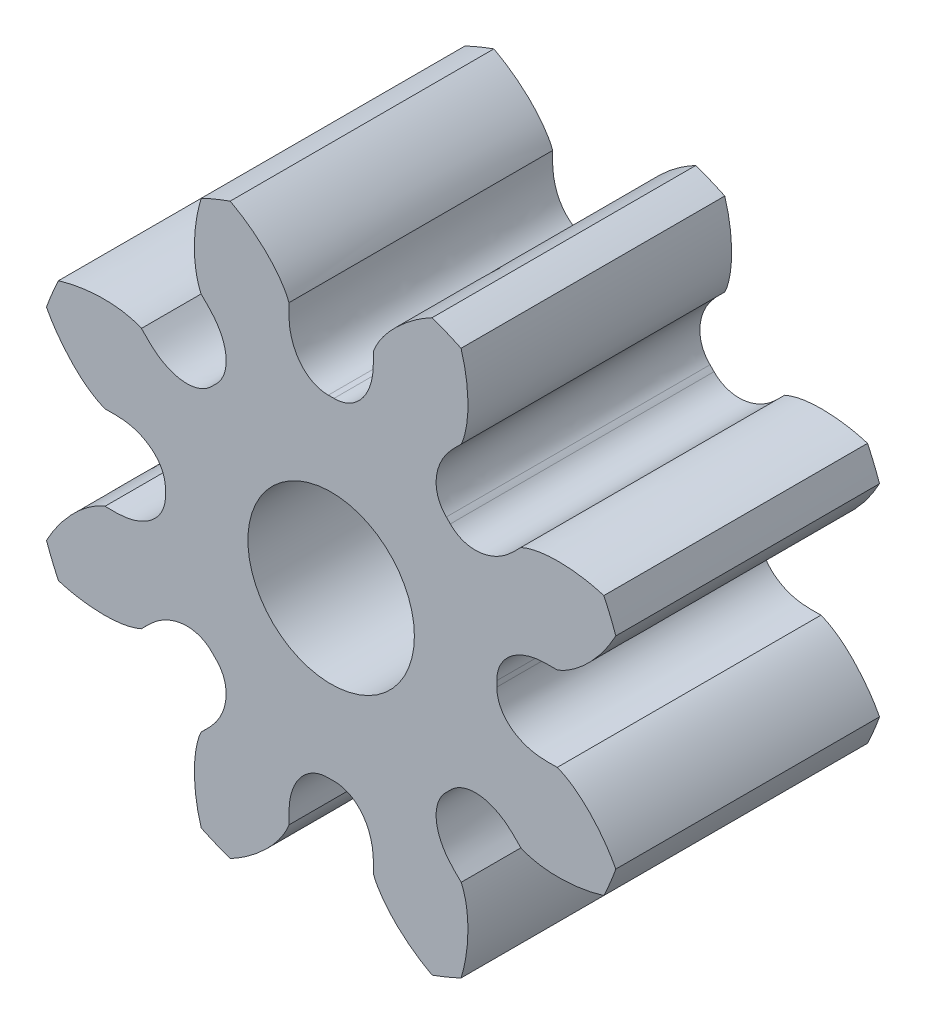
ISO-10303-21;
HEADER;
FILE_DESCRIPTION(('STEP AP214'),'2;1');
FILE_NAME('part.step','',(''),(''),'','','');
FILE_SCHEMA(('AUTOMOTIVE_DESIGN { 1 0 10303 214 1 1 1 1 }'));
ENDSEC;
DATA;
#1=APPLICATION_CONTEXT('core data for automotive mechanical design processes');
#2=APPLICATION_PROTOCOL_DEFINITION('international standard','automotive_design',2000,#1);
#3=PRODUCT_CONTEXT('',#1,'mechanical');
#4=PRODUCT('Part','Part','',(#3));
#5=PRODUCT_RELATED_PRODUCT_CATEGORY('part','',(#4));
#6=PRODUCT_DEFINITION_FORMATION('','',#4);
#7=PRODUCT_DEFINITION_CONTEXT('part definition',#1,'design');
#8=PRODUCT_DEFINITION('design','',#6,#7);
#9=PRODUCT_DEFINITION_SHAPE('','',#8);
#10=(LENGTH_UNIT() NAMED_UNIT(*) SI_UNIT(.MILLI.,.METRE.));
#11=(NAMED_UNIT(*) PLANE_ANGLE_UNIT() SI_UNIT($,.RADIAN.));
#12=(NAMED_UNIT(*) SI_UNIT($,.STERADIAN.) SOLID_ANGLE_UNIT());
#13=UNCERTAINTY_MEASURE_WITH_UNIT(LENGTH_MEASURE(1.E-05),#10,'distance_accuracy_value','');
#14=(GEOMETRIC_REPRESENTATION_CONTEXT(3) GLOBAL_UNCERTAINTY_ASSIGNED_CONTEXT((#13)) GLOBAL_UNIT_ASSIGNED_CONTEXT((#10,
#11,#12)) REPRESENTATION_CONTEXT('',''));
#15=CARTESIAN_POINT('',(0.,0.,0.));
#16=DIRECTION('',(0.,0.,1.));
#17=DIRECTION('',(1.,0.,0.));
#18=AXIS2_PLACEMENT_3D('',#15,#16,#17);
#19=CARTESIAN_POINT('',(0.,0.,3.96000003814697));
#20=DIRECTION('',(0.,0.,-1.));
#21=DIRECTION('',(-1.,0.,0.));
#22=AXIS2_PLACEMENT_3D('',#19,#20,#21);
#23=CYLINDRICAL_SURFACE('',#22,4.53571428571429);
#24=DIRECTION('',(0.,0.,-1.));
#25=VECTOR('',#24,1.);
#26=CARTESIAN_POINT('',(1.95079860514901,-4.09476359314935,3.96000003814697));
#27=LINE('',#26,#25);
#28=CARTESIAN_POINT('',(1.95079860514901,-4.09476359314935,3.96000003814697));
#29=VERTEX_POINT('',#28);
#30=CARTESIAN_POINT('',(1.95079860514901,-4.09476359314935,0.));
#31=VERTEX_POINT('',#30);
#32=EDGE_CURVE('E676',#29,#31,#27,.T.);
#33=ORIENTED_EDGE('',*,*,#32,.F.);
#34=CARTESIAN_POINT('',(0.,0.,3.96000003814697));
#35=DIRECTION('',(0.,0.,1.));
#36=DIRECTION('',(1.,0.,0.));
#37=AXIS2_PLACEMENT_3D('',#34,#35,#36);
#38=CIRCLE('',#37,4.53571428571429);
#39=CARTESIAN_POINT('',(1.51601218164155,-4.27485802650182,3.96000003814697));
#40=VERTEX_POINT('',#39);
#41=EDGE_CURVE('E788',#40,#29,#38,.T.);
#42=ORIENTED_EDGE('',*,*,#41,.F.);
#43=DIRECTION('',(0.,0.,-1.));
#44=VECTOR('',#43,1.);
#45=CARTESIAN_POINT('',(1.51601218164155,-4.27485802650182,3.96000003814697));
#46=LINE('',#45,#44);
#47=CARTESIAN_POINT('',(1.51601218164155,-4.27485802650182,0.));
#48=VERTEX_POINT('',#47);
#49=EDGE_CURVE('E777',#48,#40,#46,.F.);
#50=ORIENTED_EDGE('',*,*,#49,.F.);
#51=CARTESIAN_POINT('',(0.,0.,0.));
#52=DIRECTION('',(0.,0.,1.));
#53=DIRECTION('',(1.,0.,0.));
#54=AXIS2_PLACEMENT_3D('',#51,#52,#53);
#55=CIRCLE('',#54,4.53571428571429);
#56=EDGE_CURVE('E787',#48,#31,#55,.T.);
#57=ORIENTED_EDGE('',*,*,#56,.T.);
#58=EDGE_LOOP('',(#33,#42,#50,#57));
#59=FACE_BOUND('',#58,.T.);
#60=ADVANCED_FACE('F43',(#59),#23,.T.);
#61=DIRECTION('',(0.,0.,-1.));
#62=VECTOR('',#61,1.);
#63=CARTESIAN_POINT('',(4.09476359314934,-1.95079860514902,3.96000003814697));
#64=LINE('',#63,#62);
#65=CARTESIAN_POINT('',(4.09476359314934,-1.95079860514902,0.));
#66=VERTEX_POINT('',#65);
#67=CARTESIAN_POINT('',(4.09476359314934,-1.95079860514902,3.96000003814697));
#68=VERTEX_POINT('',#67);
#69=EDGE_CURVE('E789',#66,#68,#64,.F.);
#70=ORIENTED_EDGE('',*,*,#69,.F.);
#71=CARTESIAN_POINT('',(4.27485802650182,-1.51601218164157,0.));
#72=VERTEX_POINT('',#71);
#73=EDGE_CURVE('E713',#66,#72,#55,.T.);
#74=ORIENTED_EDGE('',*,*,#73,.T.);
#75=DIRECTION('',(0.,0.,-1.));
#76=VECTOR('',#75,1.);
#77=CARTESIAN_POINT('',(4.27485802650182,-1.51601218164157,3.96000003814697));
#78=LINE('',#77,#76);
#79=CARTESIAN_POINT('',(4.27485802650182,-1.51601218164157,3.96000003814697));
#80=VERTEX_POINT('',#79);
#81=EDGE_CURVE('E710',#80,#72,#78,.T.);
#82=ORIENTED_EDGE('',*,*,#81,.F.);
#83=EDGE_CURVE('E719',#68,#80,#38,.T.);
#84=ORIENTED_EDGE('',*,*,#83,.F.);
#85=EDGE_LOOP('',(#70,#74,#82,#84));
#86=FACE_BOUND('',#85,.T.);
#87=ADVANCED_FACE('F803',(#86),#23,.T.);
#88=DIRECTION('',(0.,0.,-1.));
#89=VECTOR('',#88,1.);
#90=CARTESIAN_POINT('',(-1.51601218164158,-4.27485802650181,3.96000003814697));
#91=LINE('',#90,#89);
#92=CARTESIAN_POINT('',(-1.51601218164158,-4.27485802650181,3.96000003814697));
#93=VERTEX_POINT('',#92);
#94=CARTESIAN_POINT('',(-1.51601218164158,-4.27485802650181,0.));
#95=VERTEX_POINT('',#94);
#96=EDGE_CURVE('E790',#93,#95,#91,.T.);
#97=ORIENTED_EDGE('',*,*,#96,.F.);
#98=CARTESIAN_POINT('',(-1.95079860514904,-4.09476359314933,3.96000003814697));
#99=VERTEX_POINT('',#98);
#100=EDGE_CURVE('E939',#99,#93,#38,.T.);
#101=ORIENTED_EDGE('',*,*,#100,.F.);
#102=DIRECTION('',(0.,0.,-1.));
#103=VECTOR('',#102,1.);
#104=CARTESIAN_POINT('',(-1.95079860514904,-4.09476359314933,3.96000003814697));
#105=LINE('',#104,#103);
#106=CARTESIAN_POINT('',(-1.95079860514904,-4.09476359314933,0.));
#107=VERTEX_POINT('',#106);
#108=EDGE_CURVE('E847',#107,#99,#105,.F.);
#109=ORIENTED_EDGE('',*,*,#108,.F.);
#110=EDGE_CURVE('E796',#107,#95,#55,.T.);
#111=ORIENTED_EDGE('',*,*,#110,.T.);
#112=EDGE_LOOP('',(#97,#101,#109,#111));
#113=FACE_BOUND('',#112,.T.);
#114=ADVANCED_FACE('F1055',(#113),#23,.T.);
#115=DIRECTION('',(0.,0.,-1.));
#116=VECTOR('',#115,1.);
#117=CARTESIAN_POINT('',(-4.09476359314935,-1.95079860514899,3.96000003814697));
#118=LINE('',#117,#116);
#119=CARTESIAN_POINT('',(-4.09476359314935,-1.95079860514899,3.96000003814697));
#120=VERTEX_POINT('',#119);
#121=CARTESIAN_POINT('',(-4.09476359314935,-1.95079860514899,0.));
#122=VERTEX_POINT('',#121);
#123=EDGE_CURVE('E849',#120,#122,#118,.T.);
#124=ORIENTED_EDGE('',*,*,#123,.F.);
#125=CARTESIAN_POINT('',(-4.27485802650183,-1.51601218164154,3.96000003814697));
#126=VERTEX_POINT('',#125);
#127=EDGE_CURVE('E941',#126,#120,#38,.T.);
#128=ORIENTED_EDGE('',*,*,#127,.F.);
#129=DIRECTION('',(0.,0.,-1.));
#130=VECTOR('',#129,1.);
#131=CARTESIAN_POINT('',(-4.27485802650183,-1.51601218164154,3.96000003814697));
#132=LINE('',#131,#130);
#133=CARTESIAN_POINT('',(-4.27485802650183,-1.51601218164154,0.));
#134=VERTEX_POINT('',#133);
#135=EDGE_CURVE('E851',#134,#126,#132,.F.);
#136=ORIENTED_EDGE('',*,*,#135,.F.);
#137=EDGE_CURVE('E798',#134,#122,#55,.T.);
#138=ORIENTED_EDGE('',*,*,#137,.T.);
#139=EDGE_LOOP('',(#124,#128,#136,#138));
#140=FACE_BOUND('',#139,.T.);
#141=ADVANCED_FACE('F1364',(#140),#23,.T.);
#142=DIRECTION('',(0.,0.,-1.));
#143=VECTOR('',#142,1.);
#144=CARTESIAN_POINT('',(-4.27485802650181,1.5160121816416,3.96000003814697));
#145=LINE('',#144,#143);
#146=CARTESIAN_POINT('',(-4.27485802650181,1.5160121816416,3.96000003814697));
#147=VERTEX_POINT('',#146);
#148=CARTESIAN_POINT('',(-4.27485802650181,1.5160121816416,0.));
#149=VERTEX_POINT('',#148);
#150=EDGE_CURVE('E853',#147,#149,#145,.T.);
#151=ORIENTED_EDGE('',*,*,#150,.F.);
#152=CARTESIAN_POINT('',(-4.09476359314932,1.95079860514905,3.96000003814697));
#153=VERTEX_POINT('',#152);
#154=EDGE_CURVE('E946',#153,#147,#38,.T.);
#155=ORIENTED_EDGE('',*,*,#154,.F.);
#156=DIRECTION('',(0.,0.,-1.));
#157=VECTOR('',#156,1.);
#158=CARTESIAN_POINT('',(-4.09476359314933,1.95079860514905,3.96000003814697));
#159=LINE('',#158,#157);
#160=CARTESIAN_POINT('',(-4.09476359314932,1.95079860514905,0.));
#161=VERTEX_POINT('',#160);
#162=EDGE_CURVE('E855',#161,#153,#159,.F.);
#163=ORIENTED_EDGE('',*,*,#162,.F.);
#164=EDGE_CURVE('E1569',#161,#149,#55,.T.);
#165=ORIENTED_EDGE('',*,*,#164,.T.);
#166=EDGE_LOOP('',(#151,#155,#163,#165));
#167=FACE_BOUND('',#166,.T.);
#168=ADVANCED_FACE('F1373',(#167),#23,.T.);
#169=DIRECTION('',(0.,0.,-1.));
#170=VECTOR('',#169,1.);
#171=CARTESIAN_POINT('',(-1.95079860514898,4.09476359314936,3.96000003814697));
#172=LINE('',#171,#170);
#173=CARTESIAN_POINT('',(-1.95079860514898,4.09476359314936,3.96000003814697));
#174=VERTEX_POINT('',#173);
#175=CARTESIAN_POINT('',(-1.95079860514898,4.09476359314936,0.));
#176=VERTEX_POINT('',#175);
#177=EDGE_CURVE('E857',#174,#176,#172,.T.);
#178=ORIENTED_EDGE('',*,*,#177,.F.);
#179=CARTESIAN_POINT('',(-1.51601218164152,4.27485802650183,3.96000003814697));
#180=VERTEX_POINT('',#179);
#181=EDGE_CURVE('E951',#180,#174,#38,.T.);
#182=ORIENTED_EDGE('',*,*,#181,.F.);
#183=DIRECTION('',(0.,0.,-1.));
#184=VECTOR('',#183,1.);
#185=CARTESIAN_POINT('',(-1.51601218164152,4.27485802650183,3.96000003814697));
#186=LINE('',#185,#184);
#187=CARTESIAN_POINT('',(-1.51601218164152,4.27485802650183,0.));
#188=VERTEX_POINT('',#187);
#189=EDGE_CURVE('E859',#188,#180,#186,.F.);
#190=ORIENTED_EDGE('',*,*,#189,.F.);
#191=EDGE_CURVE('E1438',#188,#176,#55,.T.);
#192=ORIENTED_EDGE('',*,*,#191,.T.);
#193=EDGE_LOOP('',(#178,#182,#190,#192));
#194=FACE_BOUND('',#193,.T.);
#195=ADVANCED_FACE('F1064',(#194),#23,.T.);
#196=DIRECTION('',(0.,0.,-1.));
#197=VECTOR('',#196,1.);
#198=CARTESIAN_POINT('',(1.51601218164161,4.2748580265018,3.96000003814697));
#199=LINE('',#198,#197);
#200=CARTESIAN_POINT('',(1.51601218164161,4.2748580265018,3.96000003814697));
#201=VERTEX_POINT('',#200);
#202=CARTESIAN_POINT('',(1.51601218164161,4.2748580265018,0.));
#203=VERTEX_POINT('',#202);
#204=EDGE_CURVE('E861',#201,#203,#199,.T.);
#205=ORIENTED_EDGE('',*,*,#204,.F.);
#206=CARTESIAN_POINT('',(1.95079860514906,4.09476359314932,3.96000003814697));
#207=VERTEX_POINT('',#206);
#208=EDGE_CURVE('E718',#207,#201,#38,.T.);
#209=ORIENTED_EDGE('',*,*,#208,.F.);
#210=DIRECTION('',(0.,0.,-1.));
#211=VECTOR('',#210,1.);
#212=CARTESIAN_POINT('',(1.95079860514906,4.09476359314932,3.96000003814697));
#213=LINE('',#212,#211);
#214=CARTESIAN_POINT('',(1.95079860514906,4.09476359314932,0.));
#215=VERTEX_POINT('',#214);
#216=EDGE_CURVE('E863',#215,#207,#213,.F.);
#217=ORIENTED_EDGE('',*,*,#216,.F.);
#218=EDGE_CURVE('E723',#215,#203,#55,.T.);
#219=ORIENTED_EDGE('',*,*,#218,.T.);
#220=EDGE_LOOP('',(#205,#209,#217,#219));
#221=FACE_BOUND('',#220,.T.);
#222=ADVANCED_FACE('F967',(#221),#23,.T.);
#223=DIRECTION('',(0.,0.,-1.));
#224=VECTOR('',#223,1.);
#225=CARTESIAN_POINT('',(4.09476359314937,1.95079860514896,3.96000003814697));
#226=LINE('',#225,#224);
#227=CARTESIAN_POINT('',(4.09476359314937,1.95079860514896,3.96000003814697));
#228=VERTEX_POINT('',#227);
#229=CARTESIAN_POINT('',(4.09476359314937,1.95079860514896,0.));
#230=VERTEX_POINT('',#229);
#231=EDGE_CURVE('E865',#228,#230,#226,.T.);
#232=ORIENTED_EDGE('',*,*,#231,.F.);
#233=CARTESIAN_POINT('',(4.27485802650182,1.51601218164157,3.96000003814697));
#234=VERTEX_POINT('',#233);
#235=EDGE_CURVE('E714',#234,#228,#38,.T.);
#236=ORIENTED_EDGE('',*,*,#235,.F.);
#237=DIRECTION('',(0.,0.,-1.));
#238=VECTOR('',#237,1.);
#239=CARTESIAN_POINT('',(4.27485802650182,1.51601218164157,3.96000003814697));
#240=LINE('',#239,#238);
#241=CARTESIAN_POINT('',(4.27485802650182,1.51601218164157,0.));
#242=VERTEX_POINT('',#241);
#243=EDGE_CURVE('E708',#242,#234,#240,.F.);
#244=ORIENTED_EDGE('',*,*,#243,.F.);
#245=EDGE_CURVE('E720',#242,#230,#55,.T.);
#246=ORIENTED_EDGE('',*,*,#245,.T.);
#247=EDGE_LOOP('',(#232,#236,#244,#246));
#248=FACE_BOUND('',#247,.T.);
#249=ADVANCED_FACE('F1051',(#248),#23,.T.);
#250=CARTESIAN_POINT('',(0.,0.,3.96000003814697));
#251=DIRECTION('',(0.,0.,1.));
#252=DIRECTION('',(1.,0.,0.));
#253=AXIS2_PLACEMENT_3D('',#250,#251,#252);
#254=PLANE('',#253);
#255=CARTESIAN_POINT('',(0.,0.,3.96000003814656));
#256=DIRECTION('',(0.,0.,1.));
#257=DIRECTION('',(1.,0.,0.));
#258=AXIS2_PLACEMENT_3D('',#255,#256,#257);
#259=CIRCLE('',#258,1.25);
#260=CARTESIAN_POINT('',(1.25,0.,3.96000003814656));
#261=VERTEX_POINT('',#260);
#262=EDGE_CURVE('E1031',#261,#261,#259,.T.);
#263=ORIENTED_EDGE('',*,*,#262,.F.);
#264=EDGE_LOOP('',(#263));
#265=FACE_BOUND('',#264,.T.);
#266=ORIENTED_EDGE('',*,*,#41,.T.);
#267=CARTESIAN_POINT('',(1.95327320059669,-2.84876829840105,3.96000003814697));
#268=CARTESIAN_POINT('',(1.96118621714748,-2.86692757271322,3.96000003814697));
#269=CARTESIAN_POINT('',(1.97714542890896,-2.90355174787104,3.96000003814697));
#270=CARTESIAN_POINT('',(1.9958582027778,-2.96105017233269,3.96000003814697));
#271=CARTESIAN_POINT('',(2.04468001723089,-3.14181289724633,3.96000003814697));
#272=CARTESIAN_POINT('',(2.06848917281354,-3.47402601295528,3.96000003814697));
#273=CARTESIAN_POINT('',(2.00726591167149,-3.95898980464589,3.96000003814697));
#274=CARTESIAN_POINT('',(1.89169448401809,-4.2785129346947,3.96000003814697));
#275=CARTESIAN_POINT('',(1.83132506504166,-4.44541773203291,3.96000003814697));
#276=B_SPLINE_CURVE_WITH_KNOTS('',3,(#267,#268,#269,#270,#271,#272,#273,#274,#275),
.UNSPECIFIED.,.F.,.F.,(4,1,1,1,1,1,4),(0.,0.0362730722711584,0.0731566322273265,
0.110647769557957,0.379214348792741,0.675728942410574,1.),.UNSPECIFIED.);
#277=CARTESIAN_POINT('',(1.95327320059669,-2.84876829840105,3.96000003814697));
#278=VERTEX_POINT('',#277);
#279=EDGE_CURVE('E902',#278,#29,#276,.T.);
#280=ORIENTED_EDGE('',*,*,#279,.F.);
#281=CARTESIAN_POINT('',(1.7298261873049,-1.78992122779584,3.96000003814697));
#282=CARTESIAN_POINT('',(1.72403322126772,-1.79569917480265,3.96000003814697));
#283=CARTESIAN_POINT('',(1.69769680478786,-1.82196731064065,3.96000003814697));
#284=CARTESIAN_POINT('',(1.64252172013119,-1.89322102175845,3.96000003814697));
#285=CARTESIAN_POINT('',(1.57636999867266,-2.04269512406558,3.96000003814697));
#286=CARTESIAN_POINT('',(1.56747744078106,-2.30349106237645,3.96000003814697));
#287=CARTESIAN_POINT('',(1.69960091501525,-2.60475765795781,3.96000003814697));
#288=CARTESIAN_POINT('',(1.87060053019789,-2.76924439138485,3.96000003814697));
#289=CARTESIAN_POINT('',(1.95327320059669,-2.84876829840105,3.96000003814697));
#290=B_SPLINE_CURVE_WITH_KNOTS('',3,(#281,#282,#283,#284,#285,#286,#287,#288,#289),
.UNSPECIFIED.,.F.,.F.,(4,1,1,1,1,1,4),(0.,0.0201942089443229,0.0918084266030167,
0.221187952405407,0.416920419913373,0.718100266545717,1.),.UNSPECIFIED.);
#291=CARTESIAN_POINT('',(1.7298261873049,-1.78992122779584,3.96000003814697));
#292=VERTEX_POINT('',#291);
#293=EDGE_CURVE('E923',#292,#278,#290,.T.);
#294=ORIENTED_EDGE('',*,*,#293,.F.);
#295=CARTESIAN_POINT('',(0.,0.,3.96000003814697));
#296=DIRECTION('',(0.,0.,-1.));
#297=DIRECTION('',(0.707106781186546,-0.707106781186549,0.));
#298=AXIS2_PLACEMENT_3D('',#295,#296,#297);
#299=CIRCLE('',#298,2.4892);
#300=CARTESIAN_POINT('',(1.78992122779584,-1.72982618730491,3.96000003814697));
#301=VERTEX_POINT('',#300);
#302=EDGE_CURVE('E633',#301,#292,#299,.T.);
#303=ORIENTED_EDGE('',*,*,#302,.F.);
#304=CARTESIAN_POINT('',(2.84876829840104,-1.9532732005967,3.96000003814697));
#305=CARTESIAN_POINT('',(2.76924439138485,-1.8706005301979,3.96000003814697));
#306=CARTESIAN_POINT('',(2.6047576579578,-1.69960091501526,3.96000003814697));
#307=CARTESIAN_POINT('',(2.30349106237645,-1.56747744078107,3.96000003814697));
#308=CARTESIAN_POINT('',(2.04269512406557,-1.57636999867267,3.96000003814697));
#309=CARTESIAN_POINT('',(1.89322102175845,-1.6425217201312,3.96000003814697));
#310=CARTESIAN_POINT('',(1.82196731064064,-1.69769680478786,3.96000003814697));
#311=CARTESIAN_POINT('',(1.79569917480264,-1.72403322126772,3.96000003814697));
#312=CARTESIAN_POINT('',(1.78992122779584,-1.72982618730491,3.96000003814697));
#313=B_SPLINE_CURVE_WITH_KNOTS('',3,(#304,#305,#306,#307,#308,#309,#310,#311,#312),
.UNSPECIFIED.,.F.,.F.,(4,1,1,1,1,1,4),(0.,0.281899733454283,0.583079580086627,0.778812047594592,
0.908191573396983,0.979805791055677,1.),.UNSPECIFIED.);
#314=CARTESIAN_POINT('',(2.84876829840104,-1.9532732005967,3.96000003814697));
#315=VERTEX_POINT('',#314);
#316=EDGE_CURVE('E628',#315,#301,#313,.T.);
#317=ORIENTED_EDGE('',*,*,#316,.F.);
#318=CARTESIAN_POINT('',(4.4454177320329,-1.83132506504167,3.96000003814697));
#319=CARTESIAN_POINT('',(4.2785129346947,-1.8916944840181,3.96000003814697));
#320=CARTESIAN_POINT('',(3.95898980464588,-2.0072659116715,3.96000003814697));
#321=CARTESIAN_POINT('',(3.47402601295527,-2.06848917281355,3.96000003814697));
#322=CARTESIAN_POINT('',(3.14181289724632,-2.04468001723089,3.96000003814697));
#323=CARTESIAN_POINT('',(2.96105017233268,-1.99585820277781,3.96000003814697));
#324=CARTESIAN_POINT('',(2.90355174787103,-1.97714542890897,3.96000003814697));
#325=CARTESIAN_POINT('',(2.86692757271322,-1.96118621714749,3.96000003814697));
#326=CARTESIAN_POINT('',(2.84876829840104,-1.9532732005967,3.96000003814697));
#327=B_SPLINE_CURVE_WITH_KNOTS('',3,(#318,#319,#320,#321,#322,#323,#324,#325,#326),
.UNSPECIFIED.,.F.,.F.,(4,1,1,1,1,1,4),(0.,0.324271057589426,0.620785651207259,0.889352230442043,
0.926843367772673,0.963726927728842,1.),.UNSPECIFIED.);
#328=EDGE_CURVE('E875',#68,#315,#327,.T.);
#329=ORIENTED_EDGE('',*,*,#328,.F.);
#330=ORIENTED_EDGE('',*,*,#83,.T.);
#331=CARTESIAN_POINT('',(3.39555610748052,-0.633210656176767,3.96000003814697));
#332=CARTESIAN_POINT('',(3.41399200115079,-0.640455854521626,3.96000003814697));
#333=CARTESIAN_POINT('',(3.45117407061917,-0.655068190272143,3.96000003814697));
#334=CARTESIAN_POINT('',(3.50506352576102,-0.682493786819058,3.96000003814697));
#335=CARTESIAN_POINT('',(3.66740431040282,-0.775790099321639,3.96000003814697));
#336=CARTESIAN_POINT('',(3.91915007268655,-0.993864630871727,3.96000003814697));
#337=CARTESIAN_POINT('',(4.21877987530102,-1.380077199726,3.96000003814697));
#338=CARTESIAN_POINT('',(4.36299550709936,-1.6877355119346,3.96000003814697));
#339=CARTESIAN_POINT('',(4.43832739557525,-1.84844265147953,3.96000003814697));
#340=B_SPLINE_CURVE_WITH_KNOTS('',3,(#331,#332,#333,#334,#335,#336,#337,#338,#339),
.UNSPECIFIED.,.F.,.F.,(4,1,1,1,1,1,4),(0.,0.0362730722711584,0.0731566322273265,
0.110647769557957,0.379214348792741,0.675728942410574,1.),.UNSPECIFIED.);
#341=CARTESIAN_POINT('',(3.39555610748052,-0.633210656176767,3.96000003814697));
#342=VERTEX_POINT('',#341);
#343=EDGE_CURVE('E662',#342,#80,#340,.T.);
#344=ORIENTED_EDGE('',*,*,#343,.F.);
#345=CARTESIAN_POINT('',(2.48883726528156,-0.0424936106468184,3.96000003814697));
#346=CARTESIAN_POINT('',(2.48882664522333,-0.0506754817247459,3.96000003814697));
#347=CARTESIAN_POINT('',(2.48877836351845,-0.087872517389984,3.96000003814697));
#348=CARTESIAN_POINT('',(2.50014766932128,-0.177271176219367,3.96000003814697));
#349=CARTESIAN_POINT('',(2.55906548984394,-0.329741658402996,3.96000003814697));
#350=CARTESIAN_POINT('',(2.73718807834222,-0.520440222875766,3.96000003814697));
#351=CARTESIAN_POINT('',(3.0436411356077,-0.640042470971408,3.96000003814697));
#352=CARTESIAN_POINT('',(3.28086580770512,-0.635437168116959,3.96000003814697));
#353=CARTESIAN_POINT('',(3.39555610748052,-0.633210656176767,3.96000003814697));
#354=B_SPLINE_CURVE_WITH_KNOTS('',3,(#345,#346,#347,#348,#349,#350,#351,#352,#353),
.UNSPECIFIED.,.F.,.F.,(4,1,1,1,1,1,4),(0.,0.0201942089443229,0.0918084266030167,
0.221187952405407,0.416920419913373,0.718100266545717,1.),.UNSPECIFIED.);
#355=CARTESIAN_POINT('',(2.48883726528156,-0.042493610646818,3.96000003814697));
#356=VERTEX_POINT('',#355);
#357=EDGE_CURVE('E816',#356,#342,#354,.T.);
#358=ORIENTED_EDGE('',*,*,#357,.F.);
#359=CARTESIAN_POINT('',(0.,0.,3.96000003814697));
#360=DIRECTION('',(0.,0.,-1.));
#361=DIRECTION('',(1.,0.,0.));
#362=AXIS2_PLACEMENT_3D('',#359,#360,#361);
#363=CIRCLE('',#362,2.4892);
#364=CARTESIAN_POINT('',(2.48883726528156,0.0424936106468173,3.96000003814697));
#365=VERTEX_POINT('',#364);
#366=EDGE_CURVE('E819',#365,#356,#363,.T.);
#367=ORIENTED_EDGE('',*,*,#366,.F.);
#368=CARTESIAN_POINT('',(3.39555610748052,0.633210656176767,3.96000003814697));
#369=CARTESIAN_POINT('',(3.28086580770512,0.63543716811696,3.96000003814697));
#370=CARTESIAN_POINT('',(3.0436411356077,0.640042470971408,3.96000003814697));
#371=CARTESIAN_POINT('',(2.73718807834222,0.520440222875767,3.96000003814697));
#372=CARTESIAN_POINT('',(2.55906548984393,0.329741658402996,3.96000003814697));
#373=CARTESIAN_POINT('',(2.50014766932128,0.177271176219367,3.96000003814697));
#374=CARTESIAN_POINT('',(2.48877836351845,0.0878725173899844,3.96000003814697));
#375=CARTESIAN_POINT('',(2.48882664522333,0.0506754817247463,3.96000003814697));
#376=CARTESIAN_POINT('',(2.48883726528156,0.0424936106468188,3.96000003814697));
#377=B_SPLINE_CURVE_WITH_KNOTS('',3,(#368,#369,#370,#371,#372,#373,#374,#375,#376),
.UNSPECIFIED.,.F.,.F.,(4,1,1,1,1,1,4),(0.,0.281899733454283,0.583079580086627,0.778812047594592,
0.908191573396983,0.979805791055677,1.),.UNSPECIFIED.);
#378=CARTESIAN_POINT('',(3.39555610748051,0.633210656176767,3.96000003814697));
#379=VERTEX_POINT('',#378);
#380=EDGE_CURVE('E695',#379,#365,#377,.T.);
#381=ORIENTED_EDGE('',*,*,#380,.F.);
#382=CARTESIAN_POINT('',(4.43832739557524,1.84844265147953,3.96000003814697));
#383=CARTESIAN_POINT('',(4.36299550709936,1.6877355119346,3.96000003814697));
#384=CARTESIAN_POINT('',(4.21877987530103,1.380077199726,3.96000003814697));
#385=CARTESIAN_POINT('',(3.91915007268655,0.993864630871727,3.96000003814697));
#386=CARTESIAN_POINT('',(3.66740431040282,0.775790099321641,3.96000003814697));
#387=CARTESIAN_POINT('',(3.50506352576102,0.682493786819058,3.96000003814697));
#388=CARTESIAN_POINT('',(3.45117407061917,0.655068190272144,3.96000003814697));
#389=CARTESIAN_POINT('',(3.41399200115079,0.640455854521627,3.96000003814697));
#390=CARTESIAN_POINT('',(3.39555610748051,0.633210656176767,3.96000003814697));
#391=B_SPLINE_CURVE_WITH_KNOTS('',3,(#382,#383,#384,#385,#386,#387,#388,#389,#390),
.UNSPECIFIED.,.F.,.F.,(4,1,1,1,1,1,4),(0.,0.324271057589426,0.620785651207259,0.889352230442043,
0.926843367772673,0.963726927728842,1.),.UNSPECIFIED.);
#392=EDGE_CURVE('E656',#234,#379,#391,.T.);
#393=ORIENTED_EDGE('',*,*,#392,.F.);
#394=ORIENTED_EDGE('',*,*,#235,.T.);
#395=CARTESIAN_POINT('',(2.84876829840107,1.95327320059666,3.96000003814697));
#396=CARTESIAN_POINT('',(2.86692757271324,1.96118621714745,3.96000003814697));
#397=CARTESIAN_POINT('',(2.90355174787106,1.97714542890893,3.96000003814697));
#398=CARTESIAN_POINT('',(2.96105017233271,1.99585820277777,3.96000003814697));
#399=CARTESIAN_POINT('',(3.14181289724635,2.04468001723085,3.96000003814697));
#400=CARTESIAN_POINT('',(3.4740260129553,2.06848917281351,3.96000003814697));
#401=CARTESIAN_POINT('',(3.95898980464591,2.00726591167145,3.96000003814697));
#402=CARTESIAN_POINT('',(4.27851293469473,1.89169448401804,3.96000003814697));
#403=CARTESIAN_POINT('',(4.44541773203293,1.83132506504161,3.96000003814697));
#404=B_SPLINE_CURVE_WITH_KNOTS('',3,(#395,#396,#397,#398,#399,#400,#401,#402,#403),
.UNSPECIFIED.,.F.,.F.,(4,1,1,1,1,1,4),(0.,0.0362730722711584,0.0731566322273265,
0.110647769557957,0.379214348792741,0.675728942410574,1.),.UNSPECIFIED.);
#405=CARTESIAN_POINT('',(2.84876829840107,1.95327320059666,3.96000003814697));
#406=VERTEX_POINT('',#405);
#407=EDGE_CURVE('E378',#406,#228,#404,.T.);
#408=ORIENTED_EDGE('',*,*,#407,.F.);
#409=CARTESIAN_POINT('',(1.78992122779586,1.72982618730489,3.96000003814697));
#410=CARTESIAN_POINT('',(1.79569917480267,1.7240332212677,3.96000003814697));
#411=CARTESIAN_POINT('',(1.82196731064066,1.69769680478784,3.96000003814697));
#412=CARTESIAN_POINT('',(1.89322102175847,1.64252172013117,3.96000003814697));
#413=CARTESIAN_POINT('',(2.0426951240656,1.57636999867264,3.96000003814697));
#414=CARTESIAN_POINT('',(2.30349106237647,1.56747744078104,3.96000003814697));
#415=CARTESIAN_POINT('',(2.60475765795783,1.69960091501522,3.96000003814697));
#416=CARTESIAN_POINT('',(2.76924439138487,1.87060053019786,3.96000003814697));
#417=CARTESIAN_POINT('',(2.84876829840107,1.95327320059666,3.96000003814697));
#418=B_SPLINE_CURVE_WITH_KNOTS('',3,(#409,#410,#411,#412,#413,#414,#415,#416,#417),
.UNSPECIFIED.,.F.,.F.,(4,1,1,1,1,1,4),(0.,0.0201942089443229,0.0918084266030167,
0.221187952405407,0.416920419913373,0.718100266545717,1.),.UNSPECIFIED.);
#419=CARTESIAN_POINT('',(1.78992122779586,1.72982618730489,3.96000003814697));
#420=VERTEX_POINT('',#419);
#421=EDGE_CURVE('E376',#420,#406,#418,.T.);
#422=ORIENTED_EDGE('',*,*,#421,.F.);
#423=CARTESIAN_POINT('',(0.,0.,3.96000003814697));
#424=DIRECTION('',(0.,0.,-1.));
#425=DIRECTION('',(0.707106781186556,0.707106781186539,0.));
#426=AXIS2_PLACEMENT_3D('',#423,#424,#425);
#427=CIRCLE('',#426,2.4892);
#428=CARTESIAN_POINT('',(1.72982618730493,1.78992122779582,3.96000003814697));
#429=VERTEX_POINT('',#428);
#430=EDGE_CURVE('E361',#429,#420,#427,.T.);
#431=ORIENTED_EDGE('',*,*,#430,.F.);
#432=CARTESIAN_POINT('',(1.95327320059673,2.84876829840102,3.96000003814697));
#433=CARTESIAN_POINT('',(1.87060053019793,2.76924439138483,3.96000003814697));
#434=CARTESIAN_POINT('',(1.69960091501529,2.60475765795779,3.96000003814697));
#435=CARTESIAN_POINT('',(1.5674774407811,2.30349106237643,3.96000003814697));
#436=CARTESIAN_POINT('',(1.57636999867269,2.04269512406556,3.96000003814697));
#437=CARTESIAN_POINT('',(1.64252172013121,1.89322102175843,3.96000003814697));
#438=CARTESIAN_POINT('',(1.69769680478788,1.82196731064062,3.96000003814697));
#439=CARTESIAN_POINT('',(1.72403322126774,1.79569917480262,3.96000003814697));
#440=CARTESIAN_POINT('',(1.72982618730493,1.78992122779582,3.96000003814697));
#441=B_SPLINE_CURVE_WITH_KNOTS('',3,(#432,#433,#434,#435,#436,#437,#438,#439,#440),
.UNSPECIFIED.,.F.,.F.,(4,1,1,1,1,1,4),(0.,0.281899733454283,0.583079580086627,0.778812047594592,
0.908191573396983,0.979805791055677,1.),.UNSPECIFIED.);
#442=CARTESIAN_POINT('',(1.95327320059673,2.84876829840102,3.96000003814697));
#443=VERTEX_POINT('',#442);
#444=EDGE_CURVE('E351',#443,#429,#441,.T.);
#445=ORIENTED_EDGE('',*,*,#444,.F.);
#446=CARTESIAN_POINT('',(1.83132506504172,4.44541773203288,3.96000003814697));
#447=CARTESIAN_POINT('',(1.89169448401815,4.27851293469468,3.96000003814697));
#448=CARTESIAN_POINT('',(2.00726591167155,3.95898980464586,3.96000003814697));
#449=CARTESIAN_POINT('',(2.06848917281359,3.47402601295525,3.96000003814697));
#450=CARTESIAN_POINT('',(2.04468001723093,3.1418128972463,3.96000003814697));
#451=CARTESIAN_POINT('',(1.99585820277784,2.96105017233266,3.96000003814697));
#452=CARTESIAN_POINT('',(1.977145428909,2.90355174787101,3.96000003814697));
#453=CARTESIAN_POINT('',(1.96118621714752,2.8669275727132,3.96000003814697));
#454=CARTESIAN_POINT('',(1.95327320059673,2.84876829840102,3.96000003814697));
#455=B_SPLINE_CURVE_WITH_KNOTS('',3,(#446,#447,#448,#449,#450,#451,#452,#453,#454),
.UNSPECIFIED.,.F.,.F.,(4,1,1,1,1,1,4),(0.,0.324271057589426,0.620785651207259,0.889352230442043,
0.926843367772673,0.963726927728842,1.),.UNSPECIFIED.);
#456=EDGE_CURVE('E963',#207,#443,#455,.T.);
#457=ORIENTED_EDGE('',*,*,#456,.F.);
#458=ORIENTED_EDGE('',*,*,#208,.T.);
#459=CARTESIAN_POINT('',(0.633210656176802,3.39555610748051,3.96000003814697));
#460=CARTESIAN_POINT('',(0.640455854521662,3.41399200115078,3.96000003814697));
#461=CARTESIAN_POINT('',(0.655068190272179,3.45117407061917,3.96000003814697));
#462=CARTESIAN_POINT('',(0.682493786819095,3.50506352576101,3.96000003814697));
#463=CARTESIAN_POINT('',(0.775790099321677,3.66740431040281,3.96000003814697));
#464=CARTESIAN_POINT('',(0.993864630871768,3.91915007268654,3.96000003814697));
#465=CARTESIAN_POINT('',(1.38007719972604,4.21877987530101,3.96000003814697));
#466=CARTESIAN_POINT('',(1.68773551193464,4.36299550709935,3.96000003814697));
#467=CARTESIAN_POINT('',(1.84844265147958,4.43832739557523,3.96000003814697));
#468=B_SPLINE_CURVE_WITH_KNOTS('',3,(#459,#460,#461,#462,#463,#464,#465,#466,#467),
.UNSPECIFIED.,.F.,.F.,(4,1,1,1,1,1,4),(0.,0.0362730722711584,0.0731566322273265,
0.110647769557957,0.379214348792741,0.675728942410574,1.),.UNSPECIFIED.);
#469=CARTESIAN_POINT('',(0.633210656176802,3.39555610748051,3.96000003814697));
#470=VERTEX_POINT('',#469);
#471=EDGE_CURVE('E423',#470,#201,#468,.T.);
#472=ORIENTED_EDGE('',*,*,#471,.F.);
#473=CARTESIAN_POINT('',(0.0424936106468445,2.48883726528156,3.96000003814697));
#474=CARTESIAN_POINT('',(0.050675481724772,2.48882664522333,3.96000003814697));
#475=CARTESIAN_POINT('',(0.0878725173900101,2.48877836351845,3.96000003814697));
#476=CARTESIAN_POINT('',(0.177271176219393,2.50014766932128,3.96000003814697));
#477=CARTESIAN_POINT('',(0.329741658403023,2.55906548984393,3.96000003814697));
#478=CARTESIAN_POINT('',(0.520440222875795,2.73718807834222,3.96000003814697));
#479=CARTESIAN_POINT('',(0.64004247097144,3.04364113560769,3.96000003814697));
#480=CARTESIAN_POINT('',(0.635437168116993,3.28086580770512,3.96000003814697));
#481=CARTESIAN_POINT('',(0.633210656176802,3.39555610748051,3.96000003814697));
#482=B_SPLINE_CURVE_WITH_KNOTS('',3,(#473,#474,#475,#476,#477,#478,#479,#480,#481),
.UNSPECIFIED.,.F.,.F.,(4,1,1,1,1,1,4),(0.,0.0201942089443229,0.0918084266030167,
0.221187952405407,0.416920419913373,0.718100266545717,1.),.UNSPECIFIED.);
#483=CARTESIAN_POINT('',(0.042493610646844,2.48883726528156,3.96000003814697));
#484=VERTEX_POINT('',#483);
#485=EDGE_CURVE('E977',#484,#470,#482,.T.);
#486=ORIENTED_EDGE('',*,*,#485,.F.);
#487=CARTESIAN_POINT('',(0.,0.,3.96000003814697));
#488=DIRECTION('',(0.,0.,-1.));
#489=DIRECTION('',(0.,1.,0.));
#490=AXIS2_PLACEMENT_3D('',#487,#488,#489);
#491=CIRCLE('',#490,2.4892);
#492=CARTESIAN_POINT('',(-0.0424936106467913,2.48883726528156,3.96000003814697));
#493=VERTEX_POINT('',#492);
#494=EDGE_CURVE('E979',#493,#484,#491,.T.);
#495=ORIENTED_EDGE('',*,*,#494,.F.);
#496=CARTESIAN_POINT('',(-0.633210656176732,3.39555610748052,3.96000003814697));
#497=CARTESIAN_POINT('',(-0.635437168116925,3.28086580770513,3.96000003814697));
#498=CARTESIAN_POINT('',(-0.640042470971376,3.04364113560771,3.96000003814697));
#499=CARTESIAN_POINT('',(-0.520440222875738,2.73718807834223,3.96000003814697));
#500=CARTESIAN_POINT('',(-0.32974165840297,2.55906548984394,3.96000003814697));
#501=CARTESIAN_POINT('',(-0.177271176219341,2.50014766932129,3.96000003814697));
#502=CARTESIAN_POINT('',(-0.0878725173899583,2.48877836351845,3.96000003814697));
#503=CARTESIAN_POINT('',(-0.0506754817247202,2.48882664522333,3.96000003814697));
#504=CARTESIAN_POINT('',(-0.0424936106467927,2.48883726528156,3.96000003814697));
#505=B_SPLINE_CURVE_WITH_KNOTS('',3,(#496,#497,#498,#499,#500,#501,#502,#503,#504),
.UNSPECIFIED.,.F.,.F.,(4,1,1,1,1,1,4),(0.,0.281899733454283,0.583079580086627,0.778812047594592,
0.908191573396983,0.979805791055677,1.),.UNSPECIFIED.);
#506=CARTESIAN_POINT('',(-0.633210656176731,3.39555610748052,3.96000003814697));
#507=VERTEX_POINT('',#506);
#508=EDGE_CURVE('E454',#507,#493,#505,.T.);
#509=ORIENTED_EDGE('',*,*,#508,.F.);
#510=CARTESIAN_POINT('',(-1.84844265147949,4.43832739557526,3.96000003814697));
#511=CARTESIAN_POINT('',(-1.68773551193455,4.36299550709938,3.96000003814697));
#512=CARTESIAN_POINT('',(-1.38007719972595,4.21877987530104,3.96000003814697));
#513=CARTESIAN_POINT('',(-0.993864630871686,3.91915007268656,3.96000003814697));
#514=CARTESIAN_POINT('',(-0.775790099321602,3.66740431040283,3.96000003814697));
#515=CARTESIAN_POINT('',(-0.682493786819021,3.50506352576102,3.96000003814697));
#516=CARTESIAN_POINT('',(-0.655068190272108,3.45117407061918,3.96000003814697));
#517=CARTESIAN_POINT('',(-0.640455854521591,3.41399200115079,3.96000003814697));
#518=CARTESIAN_POINT('',(-0.633210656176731,3.39555610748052,3.96000003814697));
#519=B_SPLINE_CURVE_WITH_KNOTS('',3,(#510,#511,#512,#513,#514,#515,#516,#517,#518),
.UNSPECIFIED.,.F.,.F.,(4,1,1,1,1,1,4),(0.,0.324271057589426,0.620785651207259,0.889352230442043,
0.926843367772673,0.963726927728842,1.),.UNSPECIFIED.);
#520=EDGE_CURVE('E417',#180,#507,#519,.T.);
#521=ORIENTED_EDGE('',*,*,#520,.F.);
#522=ORIENTED_EDGE('',*,*,#181,.T.);
#523=CARTESIAN_POINT('',(-1.95327320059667,2.84876829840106,3.96000003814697));
#524=CARTESIAN_POINT('',(-1.96118621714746,2.86692757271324,3.96000003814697));
#525=CARTESIAN_POINT('',(-1.97714542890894,2.90355174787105,3.96000003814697));
#526=CARTESIAN_POINT('',(-1.99585820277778,2.9610501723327,3.96000003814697));
#527=CARTESIAN_POINT('',(-2.04468001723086,3.14181289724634,3.96000003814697));
#528=CARTESIAN_POINT('',(-2.06848917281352,3.47402601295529,3.96000003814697));
#529=CARTESIAN_POINT('',(-2.00726591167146,3.9589898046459,3.96000003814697));
#530=CARTESIAN_POINT('',(-1.89169448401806,4.27851293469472,3.96000003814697));
#531=CARTESIAN_POINT('',(-1.83132506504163,4.44541773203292,3.96000003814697));
#532=B_SPLINE_CURVE_WITH_KNOTS('',3,(#523,#524,#525,#526,#527,#528,#529,#530,#531),
.UNSPECIFIED.,.F.,.F.,(4,1,1,1,1,1,4),(0.,0.0362730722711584,0.0731566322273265,
0.110647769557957,0.379214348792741,0.675728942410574,1.),.UNSPECIFIED.);
#533=CARTESIAN_POINT('',(-1.95327320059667,2.84876829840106,3.96000003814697));
#534=VERTEX_POINT('',#533);
#535=EDGE_CURVE('E1442',#534,#174,#532,.T.);
#536=ORIENTED_EDGE('',*,*,#535,.F.);
#537=CARTESIAN_POINT('',(-1.72982618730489,1.78992122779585,3.96000003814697));
#538=CARTESIAN_POINT('',(-1.7240332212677,1.79569917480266,3.96000003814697));
#539=CARTESIAN_POINT('',(-1.69769680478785,1.82196731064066,3.96000003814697));
#540=CARTESIAN_POINT('',(-1.64252172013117,1.89322102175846,3.96000003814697));
#541=CARTESIAN_POINT('',(-1.57636999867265,2.04269512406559,3.96000003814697));
#542=CARTESIAN_POINT('',(-1.56747744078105,2.30349106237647,3.96000003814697));
#543=CARTESIAN_POINT('',(-1.69960091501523,2.60475765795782,3.96000003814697));
#544=CARTESIAN_POINT('',(-1.87060053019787,2.76924439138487,3.96000003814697));
#545=CARTESIAN_POINT('',(-1.95327320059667,2.84876829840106,3.96000003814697));
#546=B_SPLINE_CURVE_WITH_KNOTS('',3,(#537,#538,#539,#540,#541,#542,#543,#544,#545),
.UNSPECIFIED.,.F.,.F.,(4,1,1,1,1,1,4),(0.,0.0201942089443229,0.0918084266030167,
0.221187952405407,0.416920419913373,0.718100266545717,1.),.UNSPECIFIED.);
#547=CARTESIAN_POINT('',(-1.72982618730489,1.78992122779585,3.96000003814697));
#548=VERTEX_POINT('',#547);
#549=EDGE_CURVE('E1612',#548,#534,#546,.T.);
#550=ORIENTED_EDGE('',*,*,#549,.F.);
#551=CARTESIAN_POINT('',(0.,0.,3.96000003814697));
#552=DIRECTION('',(0.,0.,-1.));
#553=DIRECTION('',(-0.707106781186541,0.707106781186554,0.));
#554=AXIS2_PLACEMENT_3D('',#551,#552,#553);
#555=CIRCLE('',#554,2.4892);
#556=CARTESIAN_POINT('',(-1.78992122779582,1.72982618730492,3.96000003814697));
#557=VERTEX_POINT('',#556);
#558=EDGE_CURVE('E473',#557,#548,#555,.T.);
#559=ORIENTED_EDGE('',*,*,#558,.F.);
#560=CARTESIAN_POINT('',(-2.84876829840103,1.95327320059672,3.96000003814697));
#561=CARTESIAN_POINT('',(-2.76924439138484,1.87060053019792,3.96000003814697));
#562=CARTESIAN_POINT('',(-2.60475765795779,1.69960091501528,3.96000003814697));
#563=CARTESIAN_POINT('',(-2.30349106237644,1.56747744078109,3.96000003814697));
#564=CARTESIAN_POINT('',(-2.04269512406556,1.57636999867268,3.96000003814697));
#565=CARTESIAN_POINT('',(-1.89322102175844,1.64252172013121,3.96000003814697));
#566=CARTESIAN_POINT('',(-1.82196731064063,1.69769680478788,3.96000003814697));
#567=CARTESIAN_POINT('',(-1.79569917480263,1.72403322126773,3.96000003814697));
#568=CARTESIAN_POINT('',(-1.78992122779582,1.72982618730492,3.96000003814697));
#569=B_SPLINE_CURVE_WITH_KNOTS('',3,(#560,#561,#562,#563,#564,#565,#566,#567,#568),
.UNSPECIFIED.,.F.,.F.,(4,1,1,1,1,1,4),(0.,0.281899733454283,0.583079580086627,0.778812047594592,
0.908191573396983,0.979805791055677,1.),.UNSPECIFIED.);
#570=CARTESIAN_POINT('',(-2.84876829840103,1.95327320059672,3.96000003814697));
#571=VERTEX_POINT('',#570);
#572=EDGE_CURVE('E468',#571,#557,#569,.T.);
#573=ORIENTED_EDGE('',*,*,#572,.F.);
#574=CARTESIAN_POINT('',(-4.44541773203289,1.8313250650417,3.96000003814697));
#575=CARTESIAN_POINT('',(-4.27851293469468,1.89169448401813,3.96000003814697));
#576=CARTESIAN_POINT('',(-3.95898980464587,2.00726591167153,3.96000003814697));
#577=CARTESIAN_POINT('',(-3.47402601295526,2.06848917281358,3.96000003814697));
#578=CARTESIAN_POINT('',(-3.14181289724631,2.04468001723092,3.96000003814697));
#579=CARTESIAN_POINT('',(-2.96105017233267,1.99585820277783,3.96000003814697));
#580=CARTESIAN_POINT('',(-2.90355174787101,1.97714542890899,3.96000003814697));
#581=CARTESIAN_POINT('',(-2.8669275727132,1.96118621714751,3.96000003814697));
#582=CARTESIAN_POINT('',(-2.84876829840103,1.95327320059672,3.96000003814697));
#583=B_SPLINE_CURVE_WITH_KNOTS('',3,(#574,#575,#576,#577,#578,#579,#580,#581,#582),
.UNSPECIFIED.,.F.,.F.,(4,1,1,1,1,1,4),(0.,0.324271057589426,0.620785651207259,0.889352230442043,
0.926843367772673,0.963726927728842,1.),.UNSPECIFIED.);
#584=EDGE_CURVE('E1463',#153,#571,#583,.T.);
#585=ORIENTED_EDGE('',*,*,#584,.F.);
#586=ORIENTED_EDGE('',*,*,#154,.T.);
#587=CARTESIAN_POINT('',(-3.39555610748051,0.63321065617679,3.96000003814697));
#588=CARTESIAN_POINT('',(-3.41399200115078,0.64045585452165,3.96000003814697));
#589=CARTESIAN_POINT('',(-3.45117407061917,0.655068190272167,3.96000003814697));
#590=CARTESIAN_POINT('',(-3.50506352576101,0.682493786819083,3.96000003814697));
#591=CARTESIAN_POINT('',(-3.66740431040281,0.775790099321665,3.96000003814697));
#592=CARTESIAN_POINT('',(-3.91915007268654,0.993864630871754,3.96000003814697));
#593=CARTESIAN_POINT('',(-4.21877987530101,1.38007719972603,3.96000003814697));
#594=CARTESIAN_POINT('',(-4.36299550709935,1.68773551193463,3.96000003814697));
#595=CARTESIAN_POINT('',(-4.43832739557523,1.84844265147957,3.96000003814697));
#596=B_SPLINE_CURVE_WITH_KNOTS('',3,(#587,#588,#589,#590,#591,#592,#593,#594,#595),
.UNSPECIFIED.,.F.,.F.,(4,1,1,1,1,1,4),(0.,0.0362730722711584,0.0731566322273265,
0.110647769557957,0.379214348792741,0.675728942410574,1.),.UNSPECIFIED.);
#597=CARTESIAN_POINT('',(-3.39555610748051,0.63321065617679,3.96000003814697));
#598=VERTEX_POINT('',#597);
#599=EDGE_CURVE('E503',#598,#147,#596,.T.);
#600=ORIENTED_EDGE('',*,*,#599,.F.);
#601=CARTESIAN_POINT('',(-2.48883726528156,0.0424936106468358,3.96000003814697));
#602=CARTESIAN_POINT('',(-2.48882664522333,0.0506754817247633,3.96000003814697));
#603=CARTESIAN_POINT('',(-2.48877836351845,0.0878725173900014,3.96000003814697));
#604=CARTESIAN_POINT('',(-2.50014766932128,0.177271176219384,3.96000003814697));
#605=CARTESIAN_POINT('',(-2.55906548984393,0.329741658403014,3.96000003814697));
#606=CARTESIAN_POINT('',(-2.73718807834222,0.520440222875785,3.96000003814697));
#607=CARTESIAN_POINT('',(-3.0436411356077,0.640042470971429,3.96000003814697));
#608=CARTESIAN_POINT('',(-3.28086580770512,0.635437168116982,3.96000003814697));
#609=CARTESIAN_POINT('',(-3.39555610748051,0.63321065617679,3.96000003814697));
#610=B_SPLINE_CURVE_WITH_KNOTS('',3,(#601,#602,#603,#604,#605,#606,#607,#608,#609),
.UNSPECIFIED.,.F.,.F.,(4,1,1,1,1,1,4),(0.,0.0201942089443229,0.0918084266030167,
0.221187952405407,0.416920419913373,0.718100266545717,1.),.UNSPECIFIED.);
#611=CARTESIAN_POINT('',(-2.48883726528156,0.0424936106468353,3.96000003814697));
#612=VERTEX_POINT('',#611);
#613=EDGE_CURVE('E1580',#612,#598,#610,.T.);
#614=ORIENTED_EDGE('',*,*,#613,.F.);
#615=CARTESIAN_POINT('',(0.,0.,3.96000003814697));
#616=DIRECTION('',(0.,0.,-1.));
#617=DIRECTION('',(-1.,0.,0.));
#618=AXIS2_PLACEMENT_3D('',#615,#616,#617);
#619=CIRCLE('',#618,2.4892);
#620=CARTESIAN_POINT('',(-2.48883726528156,-0.0424936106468,3.96000003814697));
#621=VERTEX_POINT('',#620);
#622=EDGE_CURVE('E1473',#621,#612,#619,.T.);
#623=ORIENTED_EDGE('',*,*,#622,.F.);
#624=CARTESIAN_POINT('',(-3.39555610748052,-0.633210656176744,3.96000003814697));
#625=CARTESIAN_POINT('',(-3.28086580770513,-0.635437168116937,3.96000003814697));
#626=CARTESIAN_POINT('',(-3.04364113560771,-0.640042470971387,3.96000003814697));
#627=CARTESIAN_POINT('',(-2.73718807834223,-0.520440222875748,3.96000003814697));
#628=CARTESIAN_POINT('',(-2.55906548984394,-0.329741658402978,3.96000003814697));
#629=CARTESIAN_POINT('',(-2.50014766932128,-0.17727117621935,3.96000003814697));
#630=CARTESIAN_POINT('',(-2.48877836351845,-0.087872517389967,3.96000003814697));
#631=CARTESIAN_POINT('',(-2.48882664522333,-0.0506754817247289,3.96000003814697));
#632=CARTESIAN_POINT('',(-2.48883726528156,-0.0424936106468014,3.96000003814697));
#633=B_SPLINE_CURVE_WITH_KNOTS('',3,(#624,#625,#626,#627,#628,#629,#630,#631,#632),
.UNSPECIFIED.,.F.,.F.,(4,1,1,1,1,1,4),(0.,0.281899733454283,0.583079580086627,0.778812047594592,
0.908191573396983,0.979805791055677,1.),.UNSPECIFIED.);
#634=CARTESIAN_POINT('',(-3.39555610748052,-0.633210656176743,3.96000003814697));
#635=VERTEX_POINT('',#634);
#636=EDGE_CURVE('E536',#635,#621,#633,.T.);
#637=ORIENTED_EDGE('',*,*,#636,.F.);
#638=CARTESIAN_POINT('',(-4.43832739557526,-1.8484426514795,3.96000003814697));
#639=CARTESIAN_POINT('',(-4.36299550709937,-1.68773551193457,3.96000003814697));
#640=CARTESIAN_POINT('',(-4.21877987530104,-1.38007719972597,3.96000003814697));
#641=CARTESIAN_POINT('',(-3.91915007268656,-0.993864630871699,3.96000003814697));
#642=CARTESIAN_POINT('',(-3.66740431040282,-0.775790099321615,3.96000003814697));
#643=CARTESIAN_POINT('',(-3.50506352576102,-0.682493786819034,3.96000003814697));
#644=CARTESIAN_POINT('',(-3.45117407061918,-0.65506819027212,3.96000003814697));
#645=CARTESIAN_POINT('',(-3.41399200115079,-0.640455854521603,3.96000003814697));
#646=CARTESIAN_POINT('',(-3.39555610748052,-0.633210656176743,3.96000003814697));
#647=B_SPLINE_CURVE_WITH_KNOTS('',3,(#638,#639,#640,#641,#642,#643,#644,#645,#646),
.UNSPECIFIED.,.F.,.F.,(4,1,1,1,1,1,4),(0.,0.324271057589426,0.620785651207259,0.889352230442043,
0.926843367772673,0.963726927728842,1.),.UNSPECIFIED.);
#648=EDGE_CURVE('E497',#126,#635,#647,.T.);
#649=ORIENTED_EDGE('',*,*,#648,.F.);
#650=ORIENTED_EDGE('',*,*,#127,.T.);
#651=CARTESIAN_POINT('',(-2.84876829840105,-1.95327320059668,3.96000003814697));
#652=CARTESIAN_POINT('',(-2.86692757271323,-1.96118621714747,3.96000003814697));
#653=CARTESIAN_POINT('',(-2.90355174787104,-1.97714542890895,3.96000003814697));
#654=CARTESIAN_POINT('',(-2.9610501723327,-1.99585820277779,3.96000003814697));
#655=CARTESIAN_POINT('',(-3.14181289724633,-2.04468001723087,3.96000003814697));
#656=CARTESIAN_POINT('',(-3.47402601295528,-2.06848917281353,3.96000003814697));
#657=CARTESIAN_POINT('',(-3.9589898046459,-2.00726591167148,3.96000003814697));
#658=CARTESIAN_POINT('',(-4.27851293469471,-1.89169448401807,3.96000003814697));
#659=CARTESIAN_POINT('',(-4.44541773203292,-1.83132506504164,3.96000003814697));
#660=B_SPLINE_CURVE_WITH_KNOTS('',3,(#651,#652,#653,#654,#655,#656,#657,#658,#659),
.UNSPECIFIED.,.F.,.F.,(4,1,1,1,1,1,4),(0.,0.0362730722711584,0.0731566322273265,
0.110647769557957,0.379214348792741,0.675728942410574,1.),.UNSPECIFIED.);
#661=CARTESIAN_POINT('',(-2.84876829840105,-1.95327320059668,3.96000003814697));
#662=VERTEX_POINT('',#661);
#663=EDGE_CURVE('E1485',#662,#120,#660,.T.);
#664=ORIENTED_EDGE('',*,*,#663,.F.);
#665=CARTESIAN_POINT('',(-1.78992122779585,-1.7298261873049,3.96000003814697));
#666=CARTESIAN_POINT('',(-1.79569917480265,-1.72403322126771,3.96000003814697));
#667=CARTESIAN_POINT('',(-1.82196731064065,-1.69769680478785,3.96000003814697));
#668=CARTESIAN_POINT('',(-1.89322102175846,-1.64252172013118,3.96000003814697));
#669=CARTESIAN_POINT('',(-2.04269512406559,-1.57636999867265,3.96000003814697));
#670=CARTESIAN_POINT('',(-2.30349106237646,-1.56747744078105,3.96000003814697));
#671=CARTESIAN_POINT('',(-2.60475765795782,-1.69960091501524,3.96000003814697));
#672=CARTESIAN_POINT('',(-2.76924439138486,-1.87060053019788,3.96000003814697));
#673=CARTESIAN_POINT('',(-2.84876829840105,-1.95327320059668,3.96000003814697));
#674=B_SPLINE_CURVE_WITH_KNOTS('',3,(#665,#666,#667,#668,#669,#670,#671,#672,#673),
.UNSPECIFIED.,.F.,.F.,(4,1,1,1,1,1,4),(0.,0.0201942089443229,0.0918084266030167,
0.221187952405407,0.416920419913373,0.718100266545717,1.),.UNSPECIFIED.);
#675=CARTESIAN_POINT('',(-1.78992122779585,-1.7298261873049,3.96000003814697));
#676=VERTEX_POINT('',#675);
#677=EDGE_CURVE('E1556',#676,#662,#674,.T.);
#678=ORIENTED_EDGE('',*,*,#677,.F.);
#679=CARTESIAN_POINT('',(0.,0.,3.96000003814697));
#680=DIRECTION('',(0.,0.,-1.));
#681=DIRECTION('',(-0.707106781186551,-0.707106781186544,0.));
#682=AXIS2_PLACEMENT_3D('',#679,#680,#681);
#683=CIRCLE('',#682,2.4892);
#684=CARTESIAN_POINT('',(-1.72982618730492,-1.78992122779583,3.96000003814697));
#685=VERTEX_POINT('',#684);
#686=EDGE_CURVE('E555',#685,#676,#683,.T.);
#687=ORIENTED_EDGE('',*,*,#686,.F.);
#688=CARTESIAN_POINT('',(-1.95327320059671,-2.84876829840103,3.96000003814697));
#689=CARTESIAN_POINT('',(-1.87060053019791,-2.76924439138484,3.96000003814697));
#690=CARTESIAN_POINT('',(-1.69960091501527,-2.6047576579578,3.96000003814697));
#691=CARTESIAN_POINT('',(-1.56747744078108,-2.30349106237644,3.96000003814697));
#692=CARTESIAN_POINT('',(-1.57636999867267,-2.04269512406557,3.96000003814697));
#693=CARTESIAN_POINT('',(-1.6425217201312,-1.89322102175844,3.96000003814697));
#694=CARTESIAN_POINT('',(-1.69769680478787,-1.82196731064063,3.96000003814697));
#695=CARTESIAN_POINT('',(-1.72403322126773,-1.79569917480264,3.96000003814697));
#696=CARTESIAN_POINT('',(-1.72982618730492,-1.78992122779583,3.96000003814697));
#697=B_SPLINE_CURVE_WITH_KNOTS('',3,(#688,#689,#690,#691,#692,#693,#694,#695,#696),
.UNSPECIFIED.,.F.,.F.,(4,1,1,1,1,1,4),(0.,0.281899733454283,0.583079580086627,0.778812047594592,
0.908191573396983,0.979805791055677,1.),.UNSPECIFIED.);
#698=CARTESIAN_POINT('',(-1.95327320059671,-2.84876829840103,3.96000003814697));
#699=VERTEX_POINT('',#698);
#700=EDGE_CURVE('E550',#699,#685,#697,.T.);
#701=ORIENTED_EDGE('',*,*,#700,.F.);
#702=CARTESIAN_POINT('',(-1.83132506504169,-4.4454177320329,3.96000003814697));
#703=CARTESIAN_POINT('',(-1.89169448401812,-4.27851293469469,3.96000003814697));
#704=CARTESIAN_POINT('',(-2.00726591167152,-3.95898980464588,3.96000003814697));
#705=CARTESIAN_POINT('',(-2.06848917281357,-3.47402601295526,3.96000003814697));
#706=CARTESIAN_POINT('',(-2.04468001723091,-3.14181289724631,3.96000003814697));
#707=CARTESIAN_POINT('',(-1.99585820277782,-2.96105017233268,3.96000003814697));
#708=CARTESIAN_POINT('',(-1.97714542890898,-2.90355174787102,3.96000003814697));
#709=CARTESIAN_POINT('',(-1.9611862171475,-2.86692757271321,3.96000003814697));
#710=CARTESIAN_POINT('',(-1.95327320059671,-2.84876829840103,3.96000003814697));
#711=B_SPLINE_CURVE_WITH_KNOTS('',3,(#702,#703,#704,#705,#706,#707,#708,#709,#710),
.UNSPECIFIED.,.F.,.F.,(4,1,1,1,1,1,4),(0.,0.324271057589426,0.620785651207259,0.889352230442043,
0.926843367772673,0.963726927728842,1.),.UNSPECIFIED.);
#712=EDGE_CURVE('E1479',#99,#699,#711,.T.);
#713=ORIENTED_EDGE('',*,*,#712,.F.);
#714=ORIENTED_EDGE('',*,*,#100,.T.);
#715=CARTESIAN_POINT('',(-0.633210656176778,-3.39555610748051,3.96000003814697));
#716=CARTESIAN_POINT('',(-0.640455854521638,-3.41399200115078,3.96000003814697));
#717=CARTESIAN_POINT('',(-0.655068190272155,-3.45117407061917,3.96000003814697));
#718=CARTESIAN_POINT('',(-0.68249378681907,-3.50506352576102,3.96000003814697));
#719=CARTESIAN_POINT('',(-0.775790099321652,-3.66740431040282,3.96000003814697));
#720=CARTESIAN_POINT('',(-0.993864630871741,-3.91915007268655,3.96000003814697));
#721=CARTESIAN_POINT('',(-1.38007719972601,-4.21877987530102,3.96000003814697));
#722=CARTESIAN_POINT('',(-1.68773551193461,-4.36299550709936,3.96000003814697));
#723=CARTESIAN_POINT('',(-1.84844265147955,-4.43832739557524,3.96000003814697));
#724=B_SPLINE_CURVE_WITH_KNOTS('',3,(#715,#716,#717,#718,#719,#720,#721,#722,#723),
.UNSPECIFIED.,.F.,.F.,(4,1,1,1,1,1,4),(0.,0.0362730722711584,0.0731566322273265,
0.110647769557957,0.379214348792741,0.675728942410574,1.),.UNSPECIFIED.);
#725=CARTESIAN_POINT('',(-0.633210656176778,-3.39555610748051,3.96000003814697));
#726=VERTEX_POINT('',#725);
#727=EDGE_CURVE('E585',#726,#93,#724,.T.);
#728=ORIENTED_EDGE('',*,*,#727,.F.);
#729=CARTESIAN_POINT('',(-0.0424936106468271,-2.48883726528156,3.96000003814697));
#730=CARTESIAN_POINT('',(-0.0506754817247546,-2.48882664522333,3.96000003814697));
#731=CARTESIAN_POINT('',(-0.0878725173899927,-2.48877836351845,3.96000003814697));
#732=CARTESIAN_POINT('',(-0.177271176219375,-2.50014766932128,3.96000003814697));
#733=CARTESIAN_POINT('',(-0.329741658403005,-2.55906548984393,3.96000003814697));
#734=CARTESIAN_POINT('',(-0.520440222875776,-2.73718807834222,3.96000003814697));
#735=CARTESIAN_POINT('',(-0.640042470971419,-3.0436411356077,3.96000003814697));
#736=CARTESIAN_POINT('',(-0.635437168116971,-3.28086580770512,3.96000003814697));
#737=CARTESIAN_POINT('',(-0.633210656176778,-3.39555610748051,3.96000003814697));
#738=B_SPLINE_CURVE_WITH_KNOTS('',3,(#729,#730,#731,#732,#733,#734,#735,#736,#737),
.UNSPECIFIED.,.F.,.F.,(4,1,1,1,1,1,4),(0.,0.0201942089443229,0.0918084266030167,
0.221187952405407,0.416920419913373,0.718100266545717,1.),.UNSPECIFIED.);
#739=CARTESIAN_POINT('',(-0.0424936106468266,-2.48883726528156,3.96000003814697));
#740=VERTEX_POINT('',#739);
#741=EDGE_CURVE('E1532',#740,#726,#738,.T.);
#742=ORIENTED_EDGE('',*,*,#741,.F.);
#743=CARTESIAN_POINT('',(0.,0.,3.96000003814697));
#744=DIRECTION('',(0.,0.,-1.));
#745=DIRECTION('',(0.,-1.,0.));
#746=AXIS2_PLACEMENT_3D('',#743,#744,#745);
#747=CIRCLE('',#746,2.4892);
#748=CARTESIAN_POINT('',(0.0424936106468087,-2.48883726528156,3.96000003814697));
#749=VERTEX_POINT('',#748);
#750=EDGE_CURVE('E1528',#749,#740,#747,.T.);
#751=ORIENTED_EDGE('',*,*,#750,.F.);
#752=CARTESIAN_POINT('',(0.633210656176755,-3.39555610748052,3.96000003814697));
#753=CARTESIAN_POINT('',(0.635437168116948,-3.28086580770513,3.96000003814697));
#754=CARTESIAN_POINT('',(0.640042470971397,-3.0436411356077,3.96000003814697));
#755=CARTESIAN_POINT('',(0.520440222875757,-2.73718807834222,3.96000003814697));
#756=CARTESIAN_POINT('',(0.329741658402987,-2.55906548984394,3.96000003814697));
#757=CARTESIAN_POINT('',(0.177271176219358,-2.50014766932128,3.96000003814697));
#758=CARTESIAN_POINT('',(0.0878725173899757,-2.48877836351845,3.96000003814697));
#759=CARTESIAN_POINT('',(0.0506754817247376,-2.48882664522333,3.96000003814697));
#760=CARTESIAN_POINT('',(0.0424936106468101,-2.48883726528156,3.96000003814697));
#761=B_SPLINE_CURVE_WITH_KNOTS('',3,(#752,#753,#754,#755,#756,#757,#758,#759,#760),
.UNSPECIFIED.,.F.,.F.,(4,1,1,1,1,1,4),(0.,0.281899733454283,0.583079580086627,0.778812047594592,
0.908191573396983,0.979805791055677,1.),.UNSPECIFIED.);
#762=CARTESIAN_POINT('',(0.633210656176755,-3.39555610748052,3.96000003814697));
#763=VERTEX_POINT('',#762);
#764=EDGE_CURVE('E616',#763,#749,#761,.T.);
#765=ORIENTED_EDGE('',*,*,#764,.F.);
#766=CARTESIAN_POINT('',(1.84844265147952,-4.43832739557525,3.96000003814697));
#767=CARTESIAN_POINT('',(1.68773551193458,-4.36299550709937,3.96000003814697));
#768=CARTESIAN_POINT('',(1.38007719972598,-4.21877987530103,3.96000003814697));
#769=CARTESIAN_POINT('',(0.993864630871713,-3.91915007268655,3.96000003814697));
#770=CARTESIAN_POINT('',(0.775790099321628,-3.66740431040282,3.96000003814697));
#771=CARTESIAN_POINT('',(0.682493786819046,-3.50506352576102,3.96000003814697));
#772=CARTESIAN_POINT('',(0.655068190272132,-3.45117407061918,3.96000003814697));
#773=CARTESIAN_POINT('',(0.640455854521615,-3.41399200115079,3.96000003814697));
#774=CARTESIAN_POINT('',(0.633210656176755,-3.39555610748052,3.96000003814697));
#775=B_SPLINE_CURVE_WITH_KNOTS('',3,(#766,#767,#768,#769,#770,#771,#772,#773,#774),
.UNSPECIFIED.,.F.,.F.,(4,1,1,1,1,1,4),(0.,0.324271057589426,0.620785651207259,0.889352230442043,
0.926843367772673,0.963726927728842,1.),.UNSPECIFIED.);
#776=EDGE_CURVE('E579',#40,#763,#775,.T.);
#777=ORIENTED_EDGE('',*,*,#776,.F.);
#778=EDGE_LOOP('',(#266,#280,#294,#303,#317,#329,#330,#344,#358,#367,#381,#393,#394,#408,#422,
#431,#445,#457,#458,#472,#486,#495,#509,#521,#522,#536,#550,#559,#573,#585,#586,#600,#614,#623,
#637,#649,#650,#664,#678,#687,#701,#713,#714,#728,#742,#751,#765,#777));
#779=FACE_BOUND('',#778,.T.);
#780=ADVANCED_FACE('F374',(#265,#779),#254,.T.);
#781=CARTESIAN_POINT('',(0.,0.,0.));
#782=DIRECTION('',(0.,0.,1.));
#783=DIRECTION('',(1.,0.,0.));
#784=AXIS2_PLACEMENT_3D('',#781,#782,#783);
#785=PLANE('',#784);
#786=CARTESIAN_POINT('',(0.,0.,0.));
#787=DIRECTION('',(0.,0.,1.));
#788=DIRECTION('',(1.,0.,0.));
#789=AXIS2_PLACEMENT_3D('',#786,#787,#788);
#790=CIRCLE('',#789,1.25);
#791=CARTESIAN_POINT('',(1.25,0.,-1.77635683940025E-12));
#792=VERTEX_POINT('',#791);
#793=EDGE_CURVE('E46',#792,#792,#790,.T.);
#794=ORIENTED_EDGE('',*,*,#793,.T.);
#795=EDGE_LOOP('',(#794));
#796=FACE_BOUND('',#795,.T.);
#797=CARTESIAN_POINT('',(1.95327320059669,-2.84876829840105,0.));
#798=CARTESIAN_POINT('',(1.96118621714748,-2.86692757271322,0.));
#799=CARTESIAN_POINT('',(1.97714542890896,-2.90355174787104,0.));
#800=CARTESIAN_POINT('',(1.9958582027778,-2.96105017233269,0.));
#801=CARTESIAN_POINT('',(2.04468001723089,-3.14181289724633,0.));
#802=CARTESIAN_POINT('',(2.06848917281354,-3.47402601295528,0.));
#803=CARTESIAN_POINT('',(2.00726591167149,-3.95898980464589,0.));
#804=CARTESIAN_POINT('',(1.89169448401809,-4.2785129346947,0.));
#805=CARTESIAN_POINT('',(1.83132506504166,-4.44541773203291,0.));
#806=B_SPLINE_CURVE_WITH_KNOTS('',3,(#797,#798,#799,#800,#801,#802,#803,#804,#805),
.UNSPECIFIED.,.F.,.F.,(4,1,1,1,1,1,4),(0.,0.0362730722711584,0.0731566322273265,
0.110647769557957,0.379214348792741,0.675728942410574,1.),.UNSPECIFIED.);
#807=CARTESIAN_POINT('',(1.95327320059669,-2.84876829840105,0.));
#808=VERTEX_POINT('',#807);
#809=EDGE_CURVE('E634',#808,#31,#806,.T.);
#810=ORIENTED_EDGE('',*,*,#809,.T.);
#811=ORIENTED_EDGE('',*,*,#56,.F.);
#812=CARTESIAN_POINT('',(1.84844265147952,-4.43832739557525,0.));
#813=CARTESIAN_POINT('',(1.68773551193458,-4.36299550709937,0.));
#814=CARTESIAN_POINT('',(1.38007719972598,-4.21877987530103,0.));
#815=CARTESIAN_POINT('',(0.993864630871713,-3.91915007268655,0.));
#816=CARTESIAN_POINT('',(0.775790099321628,-3.66740431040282,0.));
#817=CARTESIAN_POINT('',(0.682493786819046,-3.50506352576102,0.));
#818=CARTESIAN_POINT('',(0.655068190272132,-3.45117407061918,0.));
#819=CARTESIAN_POINT('',(0.640455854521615,-3.41399200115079,0.));
#820=CARTESIAN_POINT('',(0.633210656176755,-3.39555610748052,0.));
#821=B_SPLINE_CURVE_WITH_KNOTS('',3,(#812,#813,#814,#815,#816,#817,#818,#819,#820),
.UNSPECIFIED.,.F.,.F.,(4,1,1,1,1,1,4),(0.,0.324271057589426,0.620785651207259,0.889352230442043,
0.926843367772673,0.963726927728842,1.),.UNSPECIFIED.);
#822=CARTESIAN_POINT('',(0.633210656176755,-3.39555610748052,0.));
#823=VERTEX_POINT('',#822);
#824=EDGE_CURVE('E51',#823,#48,#821,.F.);
#825=ORIENTED_EDGE('',*,*,#824,.F.);
#826=CARTESIAN_POINT('',(0.633210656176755,-3.39555610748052,0.));
#827=CARTESIAN_POINT('',(0.635437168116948,-3.28086580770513,0.));
#828=CARTESIAN_POINT('',(0.640042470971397,-3.0436411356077,0.));
#829=CARTESIAN_POINT('',(0.520440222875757,-2.73718807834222,0.));
#830=CARTESIAN_POINT('',(0.329741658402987,-2.55906548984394,0.));
#831=CARTESIAN_POINT('',(0.177271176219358,-2.50014766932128,0.));
#832=CARTESIAN_POINT('',(0.0878725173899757,-2.48877836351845,0.));
#833=CARTESIAN_POINT('',(0.0506754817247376,-2.48882664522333,0.));
#834=CARTESIAN_POINT('',(0.0424936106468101,-2.48883726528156,0.));
#835=B_SPLINE_CURVE_WITH_KNOTS('',3,(#826,#827,#828,#829,#830,#831,#832,#833,#834),
.UNSPECIFIED.,.F.,.F.,(4,1,1,1,1,1,4),(0.,0.281899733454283,0.583079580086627,0.778812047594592,
0.908191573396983,0.979805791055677,1.),.UNSPECIFIED.);
#836=CARTESIAN_POINT('',(0.0424936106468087,-2.48883726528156,0.));
#837=VERTEX_POINT('',#836);
#838=EDGE_CURVE('E590',#823,#837,#835,.T.);
#839=ORIENTED_EDGE('',*,*,#838,.T.);
#840=CARTESIAN_POINT('',(0.,0.,0.));
#841=DIRECTION('',(0.,0.,-1.));
#842=DIRECTION('',(0.,-1.,0.));
#843=AXIS2_PLACEMENT_3D('',#840,#841,#842);
#844=CIRCLE('',#843,2.4892);
#845=CARTESIAN_POINT('',(-0.0424936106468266,-2.48883726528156,0.));
#846=VERTEX_POINT('',#845);
#847=EDGE_CURVE('E598',#837,#846,#844,.T.);
#848=ORIENTED_EDGE('',*,*,#847,.T.);
#849=CARTESIAN_POINT('',(-0.0424936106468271,-2.48883726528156,0.));
#850=CARTESIAN_POINT('',(-0.0506754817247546,-2.48882664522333,0.));
#851=CARTESIAN_POINT('',(-0.0878725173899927,-2.48877836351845,0.));
#852=CARTESIAN_POINT('',(-0.177271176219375,-2.50014766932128,0.));
#853=CARTESIAN_POINT('',(-0.329741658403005,-2.55906548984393,0.));
#854=CARTESIAN_POINT('',(-0.520440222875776,-2.73718807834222,0.));
#855=CARTESIAN_POINT('',(-0.640042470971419,-3.0436411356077,0.));
#856=CARTESIAN_POINT('',(-0.635437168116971,-3.28086580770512,0.));
#857=CARTESIAN_POINT('',(-0.633210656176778,-3.39555610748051,0.));
#858=B_SPLINE_CURVE_WITH_KNOTS('',3,(#849,#850,#851,#852,#853,#854,#855,#856,#857),
.UNSPECIFIED.,.F.,.F.,(4,1,1,1,1,1,4),(0.,0.0201942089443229,0.0918084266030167,
0.221187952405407,0.416920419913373,0.718100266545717,1.),.UNSPECIFIED.);
#859=CARTESIAN_POINT('',(-0.633210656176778,-3.39555610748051,0.));
#860=VERTEX_POINT('',#859);
#861=EDGE_CURVE('E605',#846,#860,#858,.T.);
#862=ORIENTED_EDGE('',*,*,#861,.T.);
#863=CARTESIAN_POINT('',(-0.633210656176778,-3.39555610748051,0.));
#864=CARTESIAN_POINT('',(-0.640455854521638,-3.41399200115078,0.));
#865=CARTESIAN_POINT('',(-0.655068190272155,-3.45117407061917,0.));
#866=CARTESIAN_POINT('',(-0.68249378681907,-3.50506352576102,0.));
#867=CARTESIAN_POINT('',(-0.775790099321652,-3.66740431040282,0.));
#868=CARTESIAN_POINT('',(-0.993864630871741,-3.91915007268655,0.));
#869=CARTESIAN_POINT('',(-1.38007719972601,-4.21877987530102,0.));
#870=CARTESIAN_POINT('',(-1.68773551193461,-4.36299550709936,0.));
#871=CARTESIAN_POINT('',(-1.84844265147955,-4.43832739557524,0.));
#872=B_SPLINE_CURVE_WITH_KNOTS('',3,(#863,#864,#865,#866,#867,#868,#869,#870,#871),
.UNSPECIFIED.,.F.,.F.,(4,1,1,1,1,1,4),(0.,0.0362730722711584,0.0731566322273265,
0.110647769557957,0.379214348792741,0.675728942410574,1.),.UNSPECIFIED.);
#873=EDGE_CURVE('E66',#860,#95,#872,.T.);
#874=ORIENTED_EDGE('',*,*,#873,.T.);
#875=ORIENTED_EDGE('',*,*,#110,.F.);
#876=CARTESIAN_POINT('',(-1.83132506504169,-4.4454177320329,0.));
#877=CARTESIAN_POINT('',(-1.89169448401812,-4.27851293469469,0.));
#878=CARTESIAN_POINT('',(-2.00726591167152,-3.95898980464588,0.));
#879=CARTESIAN_POINT('',(-2.06848917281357,-3.47402601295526,0.));
#880=CARTESIAN_POINT('',(-2.04468001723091,-3.14181289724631,0.));
#881=CARTESIAN_POINT('',(-1.99585820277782,-2.96105017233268,0.));
#882=CARTESIAN_POINT('',(-1.97714542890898,-2.90355174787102,0.));
#883=CARTESIAN_POINT('',(-1.9611862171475,-2.86692757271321,0.));
#884=CARTESIAN_POINT('',(-1.95327320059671,-2.84876829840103,0.));
#885=B_SPLINE_CURVE_WITH_KNOTS('',3,(#876,#877,#878,#879,#880,#881,#882,#883,#884),
.UNSPECIFIED.,.F.,.F.,(4,1,1,1,1,1,4),(0.,0.324271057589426,0.620785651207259,0.889352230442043,
0.926843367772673,0.963726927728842,1.),.UNSPECIFIED.);
#886=CARTESIAN_POINT('',(-1.95327320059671,-2.84876829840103,0.));
#887=VERTEX_POINT('',#886);
#888=EDGE_CURVE('E755',#887,#107,#885,.F.);
#889=ORIENTED_EDGE('',*,*,#888,.F.);
#890=CARTESIAN_POINT('',(-1.95327320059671,-2.84876829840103,0.));
#891=CARTESIAN_POINT('',(-1.87060053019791,-2.76924439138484,0.));
#892=CARTESIAN_POINT('',(-1.69960091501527,-2.6047576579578,0.));
#893=CARTESIAN_POINT('',(-1.56747744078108,-2.30349106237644,0.));
#894=CARTESIAN_POINT('',(-1.57636999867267,-2.04269512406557,0.));
#895=CARTESIAN_POINT('',(-1.6425217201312,-1.89322102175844,0.));
#896=CARTESIAN_POINT('',(-1.69769680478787,-1.82196731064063,0.));
#897=CARTESIAN_POINT('',(-1.72403322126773,-1.79569917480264,0.));
#898=CARTESIAN_POINT('',(-1.72982618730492,-1.78992122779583,0.));
#899=B_SPLINE_CURVE_WITH_KNOTS('',3,(#890,#891,#892,#893,#894,#895,#896,#897,#898),
.UNSPECIFIED.,.F.,.F.,(4,1,1,1,1,1,4),(0.,0.281899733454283,0.583079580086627,0.778812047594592,
0.908191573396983,0.979805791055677,1.),.UNSPECIFIED.);
#900=CARTESIAN_POINT('',(-1.72982618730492,-1.78992122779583,0.));
#901=VERTEX_POINT('',#900);
#902=EDGE_CURVE('E549',#887,#901,#899,.T.);
#903=ORIENTED_EDGE('',*,*,#902,.T.);
#904=CARTESIAN_POINT('',(0.,0.,0.));
#905=DIRECTION('',(0.,0.,-1.));
#906=DIRECTION('',(-0.707106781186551,-0.707106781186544,0.));
#907=AXIS2_PLACEMENT_3D('',#904,#905,#906);
#908=CIRCLE('',#907,2.4892);
#909=CARTESIAN_POINT('',(-1.78992122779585,-1.7298261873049,0.));
#910=VERTEX_POINT('',#909);
#911=EDGE_CURVE('E1496',#901,#910,#908,.T.);
#912=ORIENTED_EDGE('',*,*,#911,.T.);
#913=CARTESIAN_POINT('',(-1.78992122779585,-1.7298261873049,0.));
#914=CARTESIAN_POINT('',(-1.79569917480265,-1.72403322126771,0.));
#915=CARTESIAN_POINT('',(-1.82196731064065,-1.69769680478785,0.));
#916=CARTESIAN_POINT('',(-1.89322102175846,-1.64252172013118,0.));
#917=CARTESIAN_POINT('',(-2.04269512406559,-1.57636999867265,0.));
#918=CARTESIAN_POINT('',(-2.30349106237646,-1.56747744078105,0.));
#919=CARTESIAN_POINT('',(-2.60475765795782,-1.69960091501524,0.));
#920=CARTESIAN_POINT('',(-2.76924439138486,-1.87060053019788,0.));
#921=CARTESIAN_POINT('',(-2.84876829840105,-1.95327320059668,0.));
#922=B_SPLINE_CURVE_WITH_KNOTS('',3,(#913,#914,#915,#916,#917,#918,#919,#920,#921),
.UNSPECIFIED.,.F.,.F.,(4,1,1,1,1,1,4),(0.,0.0201942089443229,0.0918084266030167,
0.221187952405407,0.416920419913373,0.718100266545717,1.),.UNSPECIFIED.);
#923=CARTESIAN_POINT('',(-2.84876829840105,-1.95327320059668,0.));
#924=VERTEX_POINT('',#923);
#925=EDGE_CURVE('E1502',#910,#924,#922,.T.);
#926=ORIENTED_EDGE('',*,*,#925,.T.);
#927=CARTESIAN_POINT('',(-2.84876829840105,-1.95327320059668,0.));
#928=CARTESIAN_POINT('',(-2.86692757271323,-1.96118621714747,0.));
#929=CARTESIAN_POINT('',(-2.90355174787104,-1.97714542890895,0.));
#930=CARTESIAN_POINT('',(-2.9610501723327,-1.99585820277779,0.));
#931=CARTESIAN_POINT('',(-3.14181289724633,-2.04468001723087,0.));
#932=CARTESIAN_POINT('',(-3.47402601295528,-2.06848917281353,0.));
#933=CARTESIAN_POINT('',(-3.9589898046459,-2.00726591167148,0.));
#934=CARTESIAN_POINT('',(-4.27851293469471,-1.89169448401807,0.));
#935=CARTESIAN_POINT('',(-4.44541773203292,-1.83132506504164,0.));
#936=B_SPLINE_CURVE_WITH_KNOTS('',3,(#927,#928,#929,#930,#931,#932,#933,#934,#935),
.UNSPECIFIED.,.F.,.F.,(4,1,1,1,1,1,4),(0.,0.0362730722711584,0.0731566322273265,
0.110647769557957,0.379214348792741,0.675728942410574,1.),.UNSPECIFIED.);
#937=EDGE_CURVE('E556',#924,#122,#936,.T.);
#938=ORIENTED_EDGE('',*,*,#937,.T.);
#939=ORIENTED_EDGE('',*,*,#137,.F.);
#940=CARTESIAN_POINT('',(-4.43832739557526,-1.8484426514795,0.));
#941=CARTESIAN_POINT('',(-4.36299550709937,-1.68773551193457,0.));
#942=CARTESIAN_POINT('',(-4.21877987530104,-1.38007719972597,0.));
#943=CARTESIAN_POINT('',(-3.91915007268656,-0.993864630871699,0.));
#944=CARTESIAN_POINT('',(-3.66740431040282,-0.775790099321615,0.));
#945=CARTESIAN_POINT('',(-3.50506352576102,-0.682493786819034,0.));
#946=CARTESIAN_POINT('',(-3.45117407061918,-0.65506819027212,0.));
#947=CARTESIAN_POINT('',(-3.41399200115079,-0.640455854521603,0.));
#948=CARTESIAN_POINT('',(-3.39555610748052,-0.633210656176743,0.));
#949=B_SPLINE_CURVE_WITH_KNOTS('',3,(#940,#941,#942,#943,#944,#945,#946,#947,#948),
.UNSPECIFIED.,.F.,.F.,(4,1,1,1,1,1,4),(0.,0.324271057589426,0.620785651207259,0.889352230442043,
0.926843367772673,0.963726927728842,1.),.UNSPECIFIED.);
#950=CARTESIAN_POINT('',(-3.39555610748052,-0.633210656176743,0.));
#951=VERTEX_POINT('',#950);
#952=EDGE_CURVE('E748',#951,#134,#949,.F.);
#953=ORIENTED_EDGE('',*,*,#952,.F.);
#954=CARTESIAN_POINT('',(-3.39555610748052,-0.633210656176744,0.));
#955=CARTESIAN_POINT('',(-3.28086580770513,-0.635437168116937,0.));
#956=CARTESIAN_POINT('',(-3.04364113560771,-0.640042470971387,0.));
#957=CARTESIAN_POINT('',(-2.73718807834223,-0.520440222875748,0.));
#958=CARTESIAN_POINT('',(-2.55906548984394,-0.329741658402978,0.));
#959=CARTESIAN_POINT('',(-2.50014766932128,-0.17727117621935,0.));
#960=CARTESIAN_POINT('',(-2.48877836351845,-0.087872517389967,0.));
#961=CARTESIAN_POINT('',(-2.48882664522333,-0.0506754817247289,0.));
#962=CARTESIAN_POINT('',(-2.48883726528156,-0.0424936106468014,0.));
#963=B_SPLINE_CURVE_WITH_KNOTS('',3,(#954,#955,#956,#957,#958,#959,#960,#961,#962),
.UNSPECIFIED.,.F.,.F.,(4,1,1,1,1,1,4),(0.,0.281899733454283,0.583079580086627,0.778812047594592,
0.908191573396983,0.979805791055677,1.),.UNSPECIFIED.);
#964=CARTESIAN_POINT('',(-2.48883726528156,-0.0424936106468,0.));
#965=VERTEX_POINT('',#964);
#966=EDGE_CURVE('E508',#951,#965,#963,.T.);
#967=ORIENTED_EDGE('',*,*,#966,.T.);
#968=CARTESIAN_POINT('',(0.,0.,0.));
#969=DIRECTION('',(0.,0.,-1.));
#970=DIRECTION('',(-1.,0.,0.));
#971=AXIS2_PLACEMENT_3D('',#968,#969,#970);
#972=CIRCLE('',#971,2.4892);
#973=CARTESIAN_POINT('',(-2.48883726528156,0.0424936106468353,0.));
#974=VERTEX_POINT('',#973);
#975=EDGE_CURVE('E516',#965,#974,#972,.T.);
#976=ORIENTED_EDGE('',*,*,#975,.T.);
#977=CARTESIAN_POINT('',(-2.48883726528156,0.0424936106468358,0.));
#978=CARTESIAN_POINT('',(-2.48882664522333,0.0506754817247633,0.));
#979=CARTESIAN_POINT('',(-2.48877836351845,0.0878725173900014,0.));
#980=CARTESIAN_POINT('',(-2.50014766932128,0.177271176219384,0.));
#981=CARTESIAN_POINT('',(-2.55906548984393,0.329741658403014,0.));
#982=CARTESIAN_POINT('',(-2.73718807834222,0.520440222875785,0.));
#983=CARTESIAN_POINT('',(-3.0436411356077,0.640042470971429,0.));
#984=CARTESIAN_POINT('',(-3.28086580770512,0.635437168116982,0.));
#985=CARTESIAN_POINT('',(-3.39555610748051,0.63321065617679,0.));
#986=B_SPLINE_CURVE_WITH_KNOTS('',3,(#977,#978,#979,#980,#981,#982,#983,#984,#985),
.UNSPECIFIED.,.F.,.F.,(4,1,1,1,1,1,4),(0.,0.0201942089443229,0.0918084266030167,
0.221187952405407,0.416920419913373,0.718100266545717,1.),.UNSPECIFIED.);
#987=CARTESIAN_POINT('',(-3.39555610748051,0.63321065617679,0.));
#988=VERTEX_POINT('',#987);
#989=EDGE_CURVE('E523',#974,#988,#986,.T.);
#990=ORIENTED_EDGE('',*,*,#989,.T.);
#991=CARTESIAN_POINT('',(-3.39555610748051,0.63321065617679,0.));
#992=CARTESIAN_POINT('',(-3.41399200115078,0.64045585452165,0.));
#993=CARTESIAN_POINT('',(-3.45117407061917,0.655068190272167,0.));
#994=CARTESIAN_POINT('',(-3.50506352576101,0.682493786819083,0.));
#995=CARTESIAN_POINT('',(-3.66740431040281,0.775790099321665,0.));
#996=CARTESIAN_POINT('',(-3.91915007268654,0.993864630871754,0.));
#997=CARTESIAN_POINT('',(-4.21877987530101,1.38007719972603,0.));
#998=CARTESIAN_POINT('',(-4.36299550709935,1.68773551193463,0.));
#999=CARTESIAN_POINT('',(-4.43832739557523,1.84844265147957,0.));
#1000=B_SPLINE_CURVE_WITH_KNOTS('',3,(#991,#992,#993,#994,#995,#996,#997,#998,#999),
.UNSPECIFIED.,.F.,.F.,(4,1,1,1,1,1,4),(0.,0.0362730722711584,0.0731566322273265,
0.110647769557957,0.379214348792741,0.675728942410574,1.),.UNSPECIFIED.);
#1001=EDGE_CURVE('E528',#988,#149,#1000,.T.);
#1002=ORIENTED_EDGE('',*,*,#1001,.T.);
#1003=ORIENTED_EDGE('',*,*,#164,.F.);
#1004=CARTESIAN_POINT('',(-4.44541773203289,1.8313250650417,0.));
#1005=CARTESIAN_POINT('',(-4.27851293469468,1.89169448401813,0.));
#1006=CARTESIAN_POINT('',(-3.95898980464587,2.00726591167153,0.));
#1007=CARTESIAN_POINT('',(-3.47402601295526,2.06848917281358,0.));
#1008=CARTESIAN_POINT('',(-3.14181289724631,2.04468001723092,0.));
#1009=CARTESIAN_POINT('',(-2.96105017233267,1.99585820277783,0.));
#1010=CARTESIAN_POINT('',(-2.90355174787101,1.97714542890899,0.));
#1011=CARTESIAN_POINT('',(-2.8669275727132,1.96118621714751,0.));
#1012=CARTESIAN_POINT('',(-2.84876829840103,1.95327320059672,0.));
#1013=B_SPLINE_CURVE_WITH_KNOTS('',3,(#1004,#1005,#1006,#1007,#1008,#1009,#1010,#1011,#1012),
.UNSPECIFIED.,.F.,.F.,(4,1,1,1,1,1,4),(0.,0.324271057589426,0.620785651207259,0.889352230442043,
0.926843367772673,0.963726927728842,1.),.UNSPECIFIED.);
#1014=CARTESIAN_POINT('',(-2.84876829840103,1.95327320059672,0.));
#1015=VERTEX_POINT('',#1014);
#1016=EDGE_CURVE('E741',#1015,#161,#1013,.F.);
#1017=ORIENTED_EDGE('',*,*,#1016,.F.);
#1018=CARTESIAN_POINT('',(-2.84876829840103,1.95327320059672,0.));
#1019=CARTESIAN_POINT('',(-2.76924439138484,1.87060053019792,0.));
#1020=CARTESIAN_POINT('',(-2.60475765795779,1.69960091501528,0.));
#1021=CARTESIAN_POINT('',(-2.30349106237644,1.56747744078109,0.));
#1022=CARTESIAN_POINT('',(-2.04269512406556,1.57636999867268,0.));
#1023=CARTESIAN_POINT('',(-1.89322102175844,1.64252172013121,0.));
#1024=CARTESIAN_POINT('',(-1.82196731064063,1.69769680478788,0.));
#1025=CARTESIAN_POINT('',(-1.79569917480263,1.72403322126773,0.));
#1026=CARTESIAN_POINT('',(-1.78992122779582,1.72982618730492,0.));
#1027=B_SPLINE_CURVE_WITH_KNOTS('',3,(#1018,#1019,#1020,#1021,#1022,#1023,#1024,#1025,#1026),
.UNSPECIFIED.,.F.,.F.,(4,1,1,1,1,1,4),(0.,0.281899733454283,0.583079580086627,0.778812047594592,
0.908191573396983,0.979805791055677,1.),.UNSPECIFIED.);
#1028=CARTESIAN_POINT('',(-1.78992122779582,1.72982618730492,0.));
#1029=VERTEX_POINT('',#1028);
#1030=EDGE_CURVE('E467',#1015,#1029,#1027,.T.);
#1031=ORIENTED_EDGE('',*,*,#1030,.T.);
#1032=CARTESIAN_POINT('',(0.,0.,0.));
#1033=DIRECTION('',(0.,0.,-1.));
#1034=DIRECTION('',(-0.707106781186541,0.707106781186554,0.));
#1035=AXIS2_PLACEMENT_3D('',#1032,#1033,#1034);
#1036=CIRCLE('',#1035,2.4892);
#1037=CARTESIAN_POINT('',(-1.72982618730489,1.78992122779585,0.));
#1038=VERTEX_POINT('',#1037);
#1039=EDGE_CURVE('E1449',#1029,#1038,#1036,.T.);
#1040=ORIENTED_EDGE('',*,*,#1039,.T.);
#1041=CARTESIAN_POINT('',(-1.72982618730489,1.78992122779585,0.));
#1042=CARTESIAN_POINT('',(-1.7240332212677,1.79569917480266,0.));
#1043=CARTESIAN_POINT('',(-1.69769680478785,1.82196731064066,0.));
#1044=CARTESIAN_POINT('',(-1.64252172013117,1.89322102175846,0.));
#1045=CARTESIAN_POINT('',(-1.57636999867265,2.04269512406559,0.));
#1046=CARTESIAN_POINT('',(-1.56747744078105,2.30349106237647,0.));
#1047=CARTESIAN_POINT('',(-1.69960091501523,2.60475765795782,0.));
#1048=CARTESIAN_POINT('',(-1.87060053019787,2.76924439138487,0.));
#1049=CARTESIAN_POINT('',(-1.95327320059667,2.84876829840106,0.));
#1050=B_SPLINE_CURVE_WITH_KNOTS('',3,(#1041,#1042,#1043,#1044,#1045,#1046,#1047,#1048,#1049),
.UNSPECIFIED.,.F.,.F.,(4,1,1,1,1,1,4),(0.,0.0201942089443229,0.0918084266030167,
0.221187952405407,0.416920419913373,0.718100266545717,1.),.UNSPECIFIED.);
#1051=CARTESIAN_POINT('',(-1.95327320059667,2.84876829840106,0.));
#1052=VERTEX_POINT('',#1051);
#1053=EDGE_CURVE('E1447',#1038,#1052,#1050,.T.);
#1054=ORIENTED_EDGE('',*,*,#1053,.T.);
#1055=CARTESIAN_POINT('',(-1.95327320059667,2.84876829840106,0.));
#1056=CARTESIAN_POINT('',(-1.96118621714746,2.86692757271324,0.));
#1057=CARTESIAN_POINT('',(-1.97714542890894,2.90355174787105,0.));
#1058=CARTESIAN_POINT('',(-1.99585820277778,2.9610501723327,0.));
#1059=CARTESIAN_POINT('',(-2.04468001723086,3.14181289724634,0.));
#1060=CARTESIAN_POINT('',(-2.06848917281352,3.47402601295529,0.));
#1061=CARTESIAN_POINT('',(-2.00726591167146,3.9589898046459,0.));
#1062=CARTESIAN_POINT('',(-1.89169448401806,4.27851293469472,0.));
#1063=CARTESIAN_POINT('',(-1.83132506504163,4.44541773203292,0.));
#1064=B_SPLINE_CURVE_WITH_KNOTS('',3,(#1055,#1056,#1057,#1058,#1059,#1060,#1061,#1062,#1063),
.UNSPECIFIED.,.F.,.F.,(4,1,1,1,1,1,4),(0.,0.0362730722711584,0.0731566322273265,
0.110647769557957,0.379214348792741,0.675728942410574,1.),.UNSPECIFIED.);
#1065=EDGE_CURVE('E474',#1052,#176,#1064,.T.);
#1066=ORIENTED_EDGE('',*,*,#1065,.T.);
#1067=ORIENTED_EDGE('',*,*,#191,.F.);
#1068=CARTESIAN_POINT('',(-1.84844265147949,4.43832739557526,0.));
#1069=CARTESIAN_POINT('',(-1.68773551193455,4.36299550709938,0.));
#1070=CARTESIAN_POINT('',(-1.38007719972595,4.21877987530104,0.));
#1071=CARTESIAN_POINT('',(-0.993864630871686,3.91915007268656,0.));
#1072=CARTESIAN_POINT('',(-0.775790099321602,3.66740431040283,0.));
#1073=CARTESIAN_POINT('',(-0.682493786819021,3.50506352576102,0.));
#1074=CARTESIAN_POINT('',(-0.655068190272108,3.45117407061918,0.));
#1075=CARTESIAN_POINT('',(-0.640455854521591,3.41399200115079,0.));
#1076=CARTESIAN_POINT('',(-0.633210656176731,3.39555610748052,0.));
#1077=B_SPLINE_CURVE_WITH_KNOTS('',3,(#1068,#1069,#1070,#1071,#1072,#1073,#1074,#1075,#1076),
.UNSPECIFIED.,.F.,.F.,(4,1,1,1,1,1,4),(0.,0.324271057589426,0.620785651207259,0.889352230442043,
0.926843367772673,0.963726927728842,1.),.UNSPECIFIED.);
#1078=CARTESIAN_POINT('',(-0.633210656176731,3.39555610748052,0.));
#1079=VERTEX_POINT('',#1078);
#1080=EDGE_CURVE('E734',#1079,#188,#1077,.F.);
#1081=ORIENTED_EDGE('',*,*,#1080,.F.);
#1082=CARTESIAN_POINT('',(-0.633210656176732,3.39555610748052,0.));
#1083=CARTESIAN_POINT('',(-0.635437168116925,3.28086580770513,0.));
#1084=CARTESIAN_POINT('',(-0.640042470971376,3.04364113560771,0.));
#1085=CARTESIAN_POINT('',(-0.520440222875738,2.73718807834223,0.));
#1086=CARTESIAN_POINT('',(-0.32974165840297,2.55906548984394,0.));
#1087=CARTESIAN_POINT('',(-0.177271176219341,2.50014766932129,0.));
#1088=CARTESIAN_POINT('',(-0.0878725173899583,2.48877836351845,0.));
#1089=CARTESIAN_POINT('',(-0.0506754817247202,2.48882664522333,0.));
#1090=CARTESIAN_POINT('',(-0.0424936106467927,2.48883726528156,0.));
#1091=B_SPLINE_CURVE_WITH_KNOTS('',3,(#1082,#1083,#1084,#1085,#1086,#1087,#1088,#1089,#1090),
.UNSPECIFIED.,.F.,.F.,(4,1,1,1,1,1,4),(0.,0.281899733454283,0.583079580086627,0.778812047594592,
0.908191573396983,0.979805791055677,1.),.UNSPECIFIED.);
#1092=CARTESIAN_POINT('',(-0.0424936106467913,2.48883726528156,0.));
#1093=VERTEX_POINT('',#1092);
#1094=EDGE_CURVE('E369',#1079,#1093,#1091,.T.);
#1095=ORIENTED_EDGE('',*,*,#1094,.T.);
#1096=CARTESIAN_POINT('',(0.,0.,0.));
#1097=DIRECTION('',(0.,0.,-1.));
#1098=DIRECTION('',(0.,1.,0.));
#1099=AXIS2_PLACEMENT_3D('',#1096,#1097,#1098);
#1100=CIRCLE('',#1099,2.4892);
#1101=CARTESIAN_POINT('',(0.042493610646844,2.48883726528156,0.));
#1102=VERTEX_POINT('',#1101);
#1103=EDGE_CURVE('E435',#1093,#1102,#1100,.T.);
#1104=ORIENTED_EDGE('',*,*,#1103,.T.);
#1105=CARTESIAN_POINT('',(0.0424936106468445,2.48883726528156,0.));
#1106=CARTESIAN_POINT('',(0.050675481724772,2.48882664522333,0.));
#1107=CARTESIAN_POINT('',(0.0878725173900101,2.48877836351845,0.));
#1108=CARTESIAN_POINT('',(0.177271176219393,2.50014766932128,0.));
#1109=CARTESIAN_POINT('',(0.329741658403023,2.55906548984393,0.));
#1110=CARTESIAN_POINT('',(0.520440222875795,2.73718807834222,0.));
#1111=CARTESIAN_POINT('',(0.64004247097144,3.04364113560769,0.));
#1112=CARTESIAN_POINT('',(0.635437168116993,3.28086580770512,0.));
#1113=CARTESIAN_POINT('',(0.633210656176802,3.39555610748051,0.));
#1114=B_SPLINE_CURVE_WITH_KNOTS('',3,(#1105,#1106,#1107,#1108,#1109,#1110,#1111,#1112,#1113),
.UNSPECIFIED.,.F.,.F.,(4,1,1,1,1,1,4),(0.,0.0201942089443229,0.0918084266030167,
0.221187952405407,0.416920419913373,0.718100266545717,1.),.UNSPECIFIED.);
#1115=CARTESIAN_POINT('',(0.633210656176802,3.39555610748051,0.));
#1116=VERTEX_POINT('',#1115);
#1117=EDGE_CURVE('E441',#1102,#1116,#1114,.T.);
#1118=ORIENTED_EDGE('',*,*,#1117,.T.);
#1119=CARTESIAN_POINT('',(0.633210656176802,3.39555610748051,0.));
#1120=CARTESIAN_POINT('',(0.640455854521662,3.41399200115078,0.));
#1121=CARTESIAN_POINT('',(0.655068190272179,3.45117407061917,0.));
#1122=CARTESIAN_POINT('',(0.682493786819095,3.50506352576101,0.));
#1123=CARTESIAN_POINT('',(0.775790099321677,3.66740431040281,0.));
#1124=CARTESIAN_POINT('',(0.993864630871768,3.91915007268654,0.));
#1125=CARTESIAN_POINT('',(1.38007719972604,4.21877987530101,0.));
#1126=CARTESIAN_POINT('',(1.68773551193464,4.36299550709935,0.));
#1127=CARTESIAN_POINT('',(1.84844265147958,4.43832739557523,0.));
#1128=B_SPLINE_CURVE_WITH_KNOTS('',3,(#1119,#1120,#1121,#1122,#1123,#1124,#1125,#1126,#1127),
.UNSPECIFIED.,.F.,.F.,(4,1,1,1,1,1,4),(0.,0.0362730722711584,0.0731566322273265,
0.110647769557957,0.379214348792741,0.675728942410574,1.),.UNSPECIFIED.);
#1129=EDGE_CURVE('E446',#1116,#203,#1128,.T.);
#1130=ORIENTED_EDGE('',*,*,#1129,.T.);
#1131=ORIENTED_EDGE('',*,*,#218,.F.);
#1132=CARTESIAN_POINT('',(1.83132506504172,4.44541773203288,0.));
#1133=CARTESIAN_POINT('',(1.89169448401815,4.27851293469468,0.));
#1134=CARTESIAN_POINT('',(2.00726591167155,3.95898980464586,0.));
#1135=CARTESIAN_POINT('',(2.06848917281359,3.47402601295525,0.));
#1136=CARTESIAN_POINT('',(2.04468001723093,3.1418128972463,0.));
#1137=CARTESIAN_POINT('',(1.99585820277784,2.96105017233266,0.));
#1138=CARTESIAN_POINT('',(1.977145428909,2.90355174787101,0.));
#1139=CARTESIAN_POINT('',(1.96118621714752,2.8669275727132,0.));
#1140=CARTESIAN_POINT('',(1.95327320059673,2.84876829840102,0.));
#1141=B_SPLINE_CURVE_WITH_KNOTS('',3,(#1132,#1133,#1134,#1135,#1136,#1137,#1138,#1139,#1140),
.UNSPECIFIED.,.F.,.F.,(4,1,1,1,1,1,4),(0.,0.324271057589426,0.620785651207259,0.889352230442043,
0.926843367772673,0.963726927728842,1.),.UNSPECIFIED.);
#1142=CARTESIAN_POINT('',(1.95327320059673,2.84876829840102,0.));
#1143=VERTEX_POINT('',#1142);
#1144=EDGE_CURVE('E727',#1143,#215,#1141,.F.);
#1145=ORIENTED_EDGE('',*,*,#1144,.F.);
#1146=CARTESIAN_POINT('',(1.95327320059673,2.84876829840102,0.));
#1147=CARTESIAN_POINT('',(1.87060053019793,2.76924439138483,0.));
#1148=CARTESIAN_POINT('',(1.69960091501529,2.60475765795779,0.));
#1149=CARTESIAN_POINT('',(1.5674774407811,2.30349106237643,0.));
#1150=CARTESIAN_POINT('',(1.57636999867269,2.04269512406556,0.));
#1151=CARTESIAN_POINT('',(1.64252172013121,1.89322102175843,0.));
#1152=CARTESIAN_POINT('',(1.69769680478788,1.82196731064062,0.));
#1153=CARTESIAN_POINT('',(1.72403322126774,1.79569917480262,0.));
#1154=CARTESIAN_POINT('',(1.72982618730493,1.78992122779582,0.));
#1155=B_SPLINE_CURVE_WITH_KNOTS('',3,(#1146,#1147,#1148,#1149,#1150,#1151,#1152,#1153,#1154),
.UNSPECIFIED.,.F.,.F.,(4,1,1,1,1,1,4),(0.,0.281899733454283,0.583079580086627,0.778812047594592,
0.908191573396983,0.979805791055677,1.),.UNSPECIFIED.);
#1156=CARTESIAN_POINT('',(1.72982618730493,1.78992122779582,0.));
#1157=VERTEX_POINT('',#1156);
#1158=EDGE_CURVE('E1028',#1143,#1157,#1155,.T.);
#1159=ORIENTED_EDGE('',*,*,#1158,.T.);
#1160=CARTESIAN_POINT('',(0.,0.,0.));
#1161=DIRECTION('',(0.,0.,-1.));
#1162=DIRECTION('',(0.707106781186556,0.707106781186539,0.));
#1163=AXIS2_PLACEMENT_3D('',#1160,#1161,#1162);
#1164=CIRCLE('',#1163,2.4892);
#1165=CARTESIAN_POINT('',(1.78992122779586,1.72982618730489,0.));
#1166=VERTEX_POINT('',#1165);
#1167=EDGE_CURVE('E368',#1157,#1166,#1164,.T.);
#1168=ORIENTED_EDGE('',*,*,#1167,.T.);
#1169=CARTESIAN_POINT('',(1.78992122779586,1.72982618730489,0.));
#1170=CARTESIAN_POINT('',(1.79569917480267,1.7240332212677,0.));
#1171=CARTESIAN_POINT('',(1.82196731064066,1.69769680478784,0.));
#1172=CARTESIAN_POINT('',(1.89322102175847,1.64252172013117,0.));
#1173=CARTESIAN_POINT('',(2.0426951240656,1.57636999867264,0.));
#1174=CARTESIAN_POINT('',(2.30349106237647,1.56747744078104,0.));
#1175=CARTESIAN_POINT('',(2.60475765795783,1.69960091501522,0.));
#1176=CARTESIAN_POINT('',(2.76924439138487,1.87060053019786,0.));
#1177=CARTESIAN_POINT('',(2.84876829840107,1.95327320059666,0.));
#1178=B_SPLINE_CURVE_WITH_KNOTS('',3,(#1169,#1170,#1171,#1172,#1173,#1174,#1175,#1176,#1177),
.UNSPECIFIED.,.F.,.F.,(4,1,1,1,1,1,4),(0.,0.0201942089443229,0.0918084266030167,
0.221187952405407,0.416920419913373,0.718100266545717,1.),.UNSPECIFIED.);
#1179=CARTESIAN_POINT('',(2.84876829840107,1.95327320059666,0.));
#1180=VERTEX_POINT('',#1179);
#1181=EDGE_CURVE('E1016',#1166,#1180,#1178,.T.);
#1182=ORIENTED_EDGE('',*,*,#1181,.T.);
#1183=CARTESIAN_POINT('',(2.84876829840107,1.95327320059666,0.));
#1184=CARTESIAN_POINT('',(2.86692757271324,1.96118621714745,0.));
#1185=CARTESIAN_POINT('',(2.90355174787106,1.97714542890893,0.));
#1186=CARTESIAN_POINT('',(2.96105017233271,1.99585820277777,0.));
#1187=CARTESIAN_POINT('',(3.14181289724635,2.04468001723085,0.));
#1188=CARTESIAN_POINT('',(3.4740260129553,2.06848917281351,0.));
#1189=CARTESIAN_POINT('',(3.95898980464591,2.00726591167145,0.));
#1190=CARTESIAN_POINT('',(4.27851293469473,1.89169448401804,0.));
#1191=CARTESIAN_POINT('',(4.44541773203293,1.83132506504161,0.));
#1192=B_SPLINE_CURVE_WITH_KNOTS('',3,(#1183,#1184,#1185,#1186,#1187,#1188,#1189,#1190,#1191),
.UNSPECIFIED.,.F.,.F.,(4,1,1,1,1,1,4),(0.,0.0362730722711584,0.0731566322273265,
0.110647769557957,0.379214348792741,0.675728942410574,1.),.UNSPECIFIED.);
#1193=EDGE_CURVE('E362',#1180,#230,#1192,.T.);
#1194=ORIENTED_EDGE('',*,*,#1193,.T.);
#1195=ORIENTED_EDGE('',*,*,#245,.F.);
#1196=CARTESIAN_POINT('',(4.43832739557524,1.84844265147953,0.));
#1197=CARTESIAN_POINT('',(4.36299550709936,1.6877355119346,0.));
#1198=CARTESIAN_POINT('',(4.21877987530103,1.380077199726,0.));
#1199=CARTESIAN_POINT('',(3.91915007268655,0.993864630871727,0.));
#1200=CARTESIAN_POINT('',(3.66740431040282,0.775790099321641,0.));
#1201=CARTESIAN_POINT('',(3.50506352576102,0.682493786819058,0.));
#1202=CARTESIAN_POINT('',(3.45117407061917,0.655068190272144,0.));
#1203=CARTESIAN_POINT('',(3.41399200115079,0.640455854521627,0.));
#1204=CARTESIAN_POINT('',(3.39555610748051,0.633210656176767,0.));
#1205=B_SPLINE_CURVE_WITH_KNOTS('',3,(#1196,#1197,#1198,#1199,#1200,#1201,#1202,#1203,#1204),
.UNSPECIFIED.,.F.,.F.,(4,1,1,1,1,1,4),(0.,0.324271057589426,0.620785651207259,0.889352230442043,
0.926843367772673,0.963726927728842,1.),.UNSPECIFIED.);
#1206=CARTESIAN_POINT('',(3.39555610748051,0.633210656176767,0.));
#1207=VERTEX_POINT('',#1206);
#1208=EDGE_CURVE('E717',#1207,#242,#1205,.F.);
#1209=ORIENTED_EDGE('',*,*,#1208,.F.);
#1210=CARTESIAN_POINT('',(3.39555610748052,0.633210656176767,0.));
#1211=CARTESIAN_POINT('',(3.28086580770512,0.63543716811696,0.));
#1212=CARTESIAN_POINT('',(3.0436411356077,0.640042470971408,0.));
#1213=CARTESIAN_POINT('',(2.73718807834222,0.520440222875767,0.));
#1214=CARTESIAN_POINT('',(2.55906548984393,0.329741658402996,0.));
#1215=CARTESIAN_POINT('',(2.50014766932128,0.177271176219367,0.));
#1216=CARTESIAN_POINT('',(2.48877836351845,0.0878725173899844,0.));
#1217=CARTESIAN_POINT('',(2.48882664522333,0.0506754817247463,0.));
#1218=CARTESIAN_POINT('',(2.48883726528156,0.0424936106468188,0.));
#1219=B_SPLINE_CURVE_WITH_KNOTS('',3,(#1210,#1211,#1212,#1213,#1214,#1215,#1216,#1217,#1218),
.UNSPECIFIED.,.F.,.F.,(4,1,1,1,1,1,4),(0.,0.281899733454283,0.583079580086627,0.778812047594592,
0.908191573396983,0.979805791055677,1.),.UNSPECIFIED.);
#1220=CARTESIAN_POINT('',(2.48883726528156,0.0424936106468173,0.));
#1221=VERTEX_POINT('',#1220);
#1222=EDGE_CURVE('E667',#1207,#1221,#1219,.T.);
#1223=ORIENTED_EDGE('',*,*,#1222,.T.);
#1224=CARTESIAN_POINT('',(0.,0.,0.));
#1225=DIRECTION('',(0.,0.,-1.));
#1226=DIRECTION('',(1.,0.,0.));
#1227=AXIS2_PLACEMENT_3D('',#1224,#1225,#1226);
#1228=CIRCLE('',#1227,2.4892);
#1229=CARTESIAN_POINT('',(2.48883726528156,-0.042493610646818,0.));
#1230=VERTEX_POINT('',#1229);
#1231=EDGE_CURVE('E675',#1221,#1230,#1228,.T.);
#1232=ORIENTED_EDGE('',*,*,#1231,.T.);
#1233=CARTESIAN_POINT('',(2.48883726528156,-0.0424936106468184,0.));
#1234=CARTESIAN_POINT('',(2.48882664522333,-0.0506754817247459,0.));
#1235=CARTESIAN_POINT('',(2.48877836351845,-0.087872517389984,0.));
#1236=CARTESIAN_POINT('',(2.50014766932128,-0.177271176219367,0.));
#1237=CARTESIAN_POINT('',(2.55906548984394,-0.329741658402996,0.));
#1238=CARTESIAN_POINT('',(2.73718807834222,-0.520440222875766,0.));
#1239=CARTESIAN_POINT('',(3.0436411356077,-0.640042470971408,0.));
#1240=CARTESIAN_POINT('',(3.28086580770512,-0.635437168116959,0.));
#1241=CARTESIAN_POINT('',(3.39555610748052,-0.633210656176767,0.));
#1242=B_SPLINE_CURVE_WITH_KNOTS('',3,(#1233,#1234,#1235,#1236,#1237,#1238,#1239,#1240,#1241),
.UNSPECIFIED.,.F.,.F.,(4,1,1,1,1,1,4),(0.,0.0201942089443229,0.0918084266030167,
0.221187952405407,0.416920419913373,0.718100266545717,1.),.UNSPECIFIED.);
#1243=CARTESIAN_POINT('',(3.39555610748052,-0.633210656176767,0.));
#1244=VERTEX_POINT('',#1243);
#1245=EDGE_CURVE('E682',#1230,#1244,#1242,.T.);
#1246=ORIENTED_EDGE('',*,*,#1245,.T.);
#1247=CARTESIAN_POINT('',(3.39555610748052,-0.633210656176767,0.));
#1248=CARTESIAN_POINT('',(3.41399200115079,-0.640455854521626,0.));
#1249=CARTESIAN_POINT('',(3.45117407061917,-0.655068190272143,0.));
#1250=CARTESIAN_POINT('',(3.50506352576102,-0.682493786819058,0.));
#1251=CARTESIAN_POINT('',(3.66740431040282,-0.775790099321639,0.));
#1252=CARTESIAN_POINT('',(3.91915007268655,-0.993864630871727,0.));
#1253=CARTESIAN_POINT('',(4.21877987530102,-1.380077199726,0.));
#1254=CARTESIAN_POINT('',(4.36299550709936,-1.6877355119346,0.));
#1255=CARTESIAN_POINT('',(4.43832739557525,-1.84844265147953,0.));
#1256=B_SPLINE_CURVE_WITH_KNOTS('',3,(#1247,#1248,#1249,#1250,#1251,#1252,#1253,#1254,#1255),
.UNSPECIFIED.,.F.,.F.,(4,1,1,1,1,1,4),(0.,0.0362730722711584,0.0731566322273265,
0.110647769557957,0.379214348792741,0.675728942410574,1.),.UNSPECIFIED.);
#1257=EDGE_CURVE('E687',#1244,#72,#1256,.T.);
#1258=ORIENTED_EDGE('',*,*,#1257,.T.);
#1259=ORIENTED_EDGE('',*,*,#73,.F.);
#1260=CARTESIAN_POINT('',(4.4454177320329,-1.83132506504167,0.));
#1261=CARTESIAN_POINT('',(4.2785129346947,-1.8916944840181,0.));
#1262=CARTESIAN_POINT('',(3.95898980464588,-2.0072659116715,0.));
#1263=CARTESIAN_POINT('',(3.47402601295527,-2.06848917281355,0.));
#1264=CARTESIAN_POINT('',(3.14181289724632,-2.04468001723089,0.));
#1265=CARTESIAN_POINT('',(2.96105017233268,-1.99585820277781,0.));
#1266=CARTESIAN_POINT('',(2.90355174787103,-1.97714542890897,0.));
#1267=CARTESIAN_POINT('',(2.86692757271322,-1.96118621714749,0.));
#1268=CARTESIAN_POINT('',(2.84876829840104,-1.9532732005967,0.));
#1269=B_SPLINE_CURVE_WITH_KNOTS('',3,(#1260,#1261,#1262,#1263,#1264,#1265,#1266,#1267,#1268),
.UNSPECIFIED.,.F.,.F.,(4,1,1,1,1,1,4),(0.,0.324271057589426,0.620785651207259,0.889352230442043,
0.926843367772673,0.963726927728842,1.),.UNSPECIFIED.);
#1270=CARTESIAN_POINT('',(2.84876829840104,-1.9532732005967,0.));
#1271=VERTEX_POINT('',#1270);
#1272=EDGE_CURVE('E11',#1271,#66,#1269,.F.);
#1273=ORIENTED_EDGE('',*,*,#1272,.F.);
#1274=CARTESIAN_POINT('',(2.84876829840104,-1.9532732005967,0.));
#1275=CARTESIAN_POINT('',(2.76924439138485,-1.8706005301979,0.));
#1276=CARTESIAN_POINT('',(2.6047576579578,-1.69960091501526,0.));
#1277=CARTESIAN_POINT('',(2.30349106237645,-1.56747744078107,0.));
#1278=CARTESIAN_POINT('',(2.04269512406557,-1.57636999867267,0.));
#1279=CARTESIAN_POINT('',(1.89322102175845,-1.6425217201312,0.));
#1280=CARTESIAN_POINT('',(1.82196731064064,-1.69769680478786,0.));
#1281=CARTESIAN_POINT('',(1.79569917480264,-1.72403322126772,0.));
#1282=CARTESIAN_POINT('',(1.78992122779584,-1.72982618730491,0.));
#1283=B_SPLINE_CURVE_WITH_KNOTS('',3,(#1274,#1275,#1276,#1277,#1278,#1279,#1280,#1281,#1282),
.UNSPECIFIED.,.F.,.F.,(4,1,1,1,1,1,4),(0.,0.281899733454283,0.583079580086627,0.778812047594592,
0.908191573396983,0.979805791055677,1.),.UNSPECIFIED.);
#1284=CARTESIAN_POINT('',(1.78992122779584,-1.72982618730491,0.));
#1285=VERTEX_POINT('',#1284);
#1286=EDGE_CURVE('E58',#1271,#1285,#1283,.T.);
#1287=ORIENTED_EDGE('',*,*,#1286,.T.);
#1288=CARTESIAN_POINT('',(0.,0.,0.));
#1289=DIRECTION('',(0.,0.,-1.));
#1290=DIRECTION('',(0.707106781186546,-0.707106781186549,0.));
#1291=AXIS2_PLACEMENT_3D('',#1288,#1289,#1290);
#1292=CIRCLE('',#1291,2.4892);
#1293=CARTESIAN_POINT('',(1.7298261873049,-1.78992122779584,0.));
#1294=VERTEX_POINT('',#1293);
#1295=EDGE_CURVE('E886',#1285,#1294,#1292,.T.);
#1296=ORIENTED_EDGE('',*,*,#1295,.T.);
#1297=CARTESIAN_POINT('',(1.7298261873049,-1.78992122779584,0.));
#1298=CARTESIAN_POINT('',(1.72403322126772,-1.79569917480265,0.));
#1299=CARTESIAN_POINT('',(1.69769680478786,-1.82196731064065,0.));
#1300=CARTESIAN_POINT('',(1.64252172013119,-1.89322102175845,0.));
#1301=CARTESIAN_POINT('',(1.57636999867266,-2.04269512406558,0.));
#1302=CARTESIAN_POINT('',(1.56747744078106,-2.30349106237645,0.));
#1303=CARTESIAN_POINT('',(1.69960091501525,-2.60475765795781,0.));
#1304=CARTESIAN_POINT('',(1.87060053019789,-2.76924439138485,0.));
#1305=CARTESIAN_POINT('',(1.95327320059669,-2.84876829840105,0.));
#1306=B_SPLINE_CURVE_WITH_KNOTS('',3,(#1297,#1298,#1299,#1300,#1301,#1302,#1303,#1304,#1305),
.UNSPECIFIED.,.F.,.F.,(4,1,1,1,1,1,4),(0.,0.0201942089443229,0.0918084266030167,
0.221187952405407,0.416920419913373,0.718100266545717,1.),.UNSPECIFIED.);
#1307=EDGE_CURVE('E879',#1294,#808,#1306,.T.);
#1308=ORIENTED_EDGE('',*,*,#1307,.T.);
#1309=EDGE_LOOP('',(#810,#811,#825,#839,#848,#862,#874,#875,#889,#903,#912,#926,#938,#939,#953,
#967,#976,#990,#1002,#1003,#1017,#1031,#1040,#1054,#1066,#1067,#1081,#1095,#1104,#1118,#1130,
#1131,#1145,#1159,#1168,#1182,#1194,#1195,#1209,#1223,#1232,#1246,#1258,#1259,#1273,#1287,#1296,#1308));
#1310=FACE_BOUND('',#1309,.T.);
#1311=ADVANCED_FACE('F793',(#796,#1310),#785,.F.);
#1312=DIRECTION('',(0.,0.,-1.));
#1313=VECTOR('',#1312,1.);
#1314=SURFACE_OF_LINEAR_EXTRUSION('',#340,#1313);
#1315=ORIENTED_EDGE('',*,*,#81,.T.);
#1316=ORIENTED_EDGE('',*,*,#1257,.F.);
#1317=DIRECTION('',(0.,0.,-1.));
#1318=VECTOR('',#1317,1.);
#1319=CARTESIAN_POINT('',(3.39555610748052,-0.633210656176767,3.96000003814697));
#1320=LINE('',#1319,#1318);
#1321=EDGE_CURVE('E701',#342,#1244,#1320,.T.);
#1322=ORIENTED_EDGE('',*,*,#1321,.F.);
#1323=ORIENTED_EDGE('',*,*,#343,.T.);
#1324=EDGE_LOOP('',(#1315,#1316,#1322,#1323));
#1325=FACE_BOUND('',#1324,.T.);
#1326=ADVANCED_FACE('F652',(#1325),#1314,.T.);
#1327=DIRECTION('',(0.,0.,-1.));
#1328=VECTOR('',#1327,1.);
#1329=SURFACE_OF_LINEAR_EXTRUSION('',#391,#1328);
#1330=ORIENTED_EDGE('',*,*,#243,.T.);
#1331=ORIENTED_EDGE('',*,*,#392,.T.);
#1332=DIRECTION('',(0.,0.,-1.));
#1333=VECTOR('',#1332,1.);
#1334=CARTESIAN_POINT('',(3.39555610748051,0.633210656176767,3.96000003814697));
#1335=LINE('',#1334,#1333);
#1336=EDGE_CURVE('E661',#379,#1207,#1335,.T.);
#1337=ORIENTED_EDGE('',*,*,#1336,.T.);
#1338=ORIENTED_EDGE('',*,*,#1208,.T.);
#1339=EDGE_LOOP('',(#1330,#1331,#1337,#1338));
#1340=FACE_BOUND('',#1339,.T.);
#1341=ADVANCED_FACE('F647',(#1340),#1329,.T.);
#1342=DIRECTION('',(0.,0.,-1.));
#1343=VECTOR('',#1342,1.);
#1344=SURFACE_OF_LINEAR_EXTRUSION('',#377,#1343);
#1345=ORIENTED_EDGE('',*,*,#1222,.F.);
#1346=ORIENTED_EDGE('',*,*,#1336,.F.);
#1347=ORIENTED_EDGE('',*,*,#380,.T.);
#1348=DIRECTION('',(0.,0.,-1.));
#1349=VECTOR('',#1348,1.);
#1350=CARTESIAN_POINT('',(2.48883726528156,0.0424936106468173,3.96000003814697));
#1351=LINE('',#1350,#1349);
#1352=EDGE_CURVE('E705',#365,#1221,#1351,.T.);
#1353=ORIENTED_EDGE('',*,*,#1352,.T.);
#1354=EDGE_LOOP('',(#1345,#1346,#1347,#1353));
#1355=FACE_BOUND('',#1354,.T.);
#1356=ADVANCED_FACE('F651',(#1355),#1344,.T.);
#1357=CARTESIAN_POINT('',(0.,0.,3.96000003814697));
#1358=DIRECTION('',(0.,0.,-1.));
#1359=DIRECTION('',(-1.,0.,0.));
#1360=AXIS2_PLACEMENT_3D('',#1357,#1358,#1359);
#1361=CYLINDRICAL_SURFACE('',#1360,2.4892);
#1362=ORIENTED_EDGE('',*,*,#1231,.F.);
#1363=ORIENTED_EDGE('',*,*,#1352,.F.);
#1364=ORIENTED_EDGE('',*,*,#366,.T.);
#1365=DIRECTION('',(0.,0.,-1.));
#1366=VECTOR('',#1365,1.);
#1367=CARTESIAN_POINT('',(2.48883726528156,-0.042493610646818,3.96000003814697));
#1368=LINE('',#1367,#1366);
#1369=EDGE_CURVE('E703',#356,#1230,#1368,.T.);
#1370=ORIENTED_EDGE('',*,*,#1369,.T.);
#1371=EDGE_LOOP('',(#1362,#1363,#1364,#1370));
#1372=FACE_BOUND('',#1371,.T.);
#1373=ADVANCED_FACE('F830',(#1372),#1361,.T.);
#1374=DIRECTION('',(0.,0.,-1.));
#1375=VECTOR('',#1374,1.);
#1376=SURFACE_OF_LINEAR_EXTRUSION('',#354,#1375);
#1377=ORIENTED_EDGE('',*,*,#1245,.F.);
#1378=ORIENTED_EDGE('',*,*,#1369,.F.);
#1379=ORIENTED_EDGE('',*,*,#357,.T.);
#1380=ORIENTED_EDGE('',*,*,#1321,.T.);
#1381=EDGE_LOOP('',(#1377,#1378,#1379,#1380));
#1382=FACE_BOUND('',#1381,.T.);
#1383=ADVANCED_FACE('F814',(#1382),#1376,.T.);
#1384=DIRECTION('',(0.,0.,-1.));
#1385=VECTOR('',#1384,1.);
#1386=SURFACE_OF_LINEAR_EXTRUSION('',#404,#1385);
#1387=ORIENTED_EDGE('',*,*,#231,.T.);
#1388=ORIENTED_EDGE('',*,*,#1193,.F.);
#1389=DIRECTION('',(0.,0.,-1.));
#1390=VECTOR('',#1389,1.);
#1391=CARTESIAN_POINT('',(2.84876829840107,1.95327320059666,3.96000003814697));
#1392=LINE('',#1391,#1390);
#1393=EDGE_CURVE('E1009',#406,#1180,#1392,.T.);
#1394=ORIENTED_EDGE('',*,*,#1393,.F.);
#1395=ORIENTED_EDGE('',*,*,#407,.T.);
#1396=EDGE_LOOP('',(#1387,#1388,#1394,#1395));
#1397=FACE_BOUND('',#1396,.T.);
#1398=ADVANCED_FACE('F400',(#1397),#1386,.T.);
#1399=DIRECTION('',(0.,0.,-1.));
#1400=VECTOR('',#1399,1.);
#1401=SURFACE_OF_LINEAR_EXTRUSION('',#418,#1400);
#1402=ORIENTED_EDGE('',*,*,#1181,.F.);
#1403=DIRECTION('',(0.,0.,-1.));
#1404=VECTOR('',#1403,1.);
#1405=CARTESIAN_POINT('',(1.78992122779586,1.72982618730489,3.96000003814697));
#1406=LINE('',#1405,#1404);
#1407=EDGE_CURVE('E370',#420,#1166,#1406,.T.);
#1408=ORIENTED_EDGE('',*,*,#1407,.F.);
#1409=ORIENTED_EDGE('',*,*,#421,.T.);
#1410=ORIENTED_EDGE('',*,*,#1393,.T.);
#1411=EDGE_LOOP('',(#1402,#1408,#1409,#1410));
#1412=FACE_BOUND('',#1411,.T.);
#1413=ADVANCED_FACE('F396',(#1412),#1401,.T.);
#1414=CARTESIAN_POINT('',(0.,0.,3.96000003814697));
#1415=DIRECTION('',(0.,0.,-1.));
#1416=DIRECTION('',(-1.,0.,0.));
#1417=AXIS2_PLACEMENT_3D('',#1414,#1415,#1416);
#1418=CYLINDRICAL_SURFACE('',#1417,2.4892);
#1419=ORIENTED_EDGE('',*,*,#1167,.F.);
#1420=DIRECTION('',(0.,0.,-1.));
#1421=VECTOR('',#1420,1.);
#1422=CARTESIAN_POINT('',(1.72982618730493,1.78992122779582,3.96000003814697));
#1423=LINE('',#1422,#1421);
#1424=EDGE_CURVE('E355',#429,#1157,#1423,.T.);
#1425=ORIENTED_EDGE('',*,*,#1424,.F.);
#1426=ORIENTED_EDGE('',*,*,#430,.T.);
#1427=ORIENTED_EDGE('',*,*,#1407,.T.);
#1428=EDGE_LOOP('',(#1419,#1425,#1426,#1427));
#1429=FACE_BOUND('',#1428,.T.);
#1430=ADVANCED_FACE('F365',(#1429),#1418,.T.);
#1431=DIRECTION('',(0.,0.,-1.));
#1432=VECTOR('',#1431,1.);
#1433=SURFACE_OF_LINEAR_EXTRUSION('',#441,#1432);
#1434=ORIENTED_EDGE('',*,*,#1158,.F.);
#1435=DIRECTION('',(0.,0.,-1.));
#1436=VECTOR('',#1435,1.);
#1437=CARTESIAN_POINT('',(1.95327320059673,2.84876829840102,3.96000003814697));
#1438=LINE('',#1437,#1436);
#1439=EDGE_CURVE('E357',#443,#1143,#1438,.T.);
#1440=ORIENTED_EDGE('',*,*,#1439,.F.);
#1441=ORIENTED_EDGE('',*,*,#444,.T.);
#1442=ORIENTED_EDGE('',*,*,#1424,.T.);
#1443=EDGE_LOOP('',(#1434,#1440,#1441,#1442));
#1444=FACE_BOUND('',#1443,.T.);
#1445=ADVANCED_FACE('F354',(#1444),#1433,.T.);
#1446=DIRECTION('',(0.,0.,-1.));
#1447=VECTOR('',#1446,1.);
#1448=SURFACE_OF_LINEAR_EXTRUSION('',#455,#1447);
#1449=ORIENTED_EDGE('',*,*,#216,.T.);
#1450=ORIENTED_EDGE('',*,*,#456,.T.);
#1451=ORIENTED_EDGE('',*,*,#1439,.T.);
#1452=ORIENTED_EDGE('',*,*,#1144,.T.);
#1453=EDGE_LOOP('',(#1449,#1450,#1451,#1452));
#1454=FACE_BOUND('',#1453,.T.);
#1455=ADVANCED_FACE('F407',(#1454),#1448,.T.);
#1456=DIRECTION('',(0.,0.,-1.));
#1457=VECTOR('',#1456,1.);
#1458=SURFACE_OF_LINEAR_EXTRUSION('',#482,#1457);
#1459=ORIENTED_EDGE('',*,*,#1117,.F.);
#1460=DIRECTION('',(0.,0.,-1.));
#1461=VECTOR('',#1460,1.);
#1462=CARTESIAN_POINT('',(0.042493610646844,2.48883726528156,3.96000003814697));
#1463=LINE('',#1462,#1461);
#1464=EDGE_CURVE('E462',#484,#1102,#1463,.T.);
#1465=ORIENTED_EDGE('',*,*,#1464,.F.);
#1466=ORIENTED_EDGE('',*,*,#485,.T.);
#1467=DIRECTION('',(0.,0.,-1.));
#1468=VECTOR('',#1467,1.);
#1469=CARTESIAN_POINT('',(0.633210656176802,3.39555610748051,3.96000003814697));
#1470=LINE('',#1469,#1468);
#1471=EDGE_CURVE('E459',#470,#1116,#1470,.T.);
#1472=ORIENTED_EDGE('',*,*,#1471,.T.);
#1473=EDGE_LOOP('',(#1459,#1465,#1466,#1472));
#1474=FACE_BOUND('',#1473,.T.);
#1475=ADVANCED_FACE('F976',(#1474),#1458,.T.);
#1476=CARTESIAN_POINT('',(0.,0.,3.96000003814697));
#1477=DIRECTION('',(0.,0.,-1.));
#1478=DIRECTION('',(-1.,0.,0.));
#1479=AXIS2_PLACEMENT_3D('',#1476,#1477,#1478);
#1480=CYLINDRICAL_SURFACE('',#1479,2.4892);
#1481=ORIENTED_EDGE('',*,*,#1103,.F.);
#1482=DIRECTION('',(0.,0.,-1.));
#1483=VECTOR('',#1482,1.);
#1484=CARTESIAN_POINT('',(-0.0424936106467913,2.48883726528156,3.96000003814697));
#1485=LINE('',#1484,#1483);
#1486=EDGE_CURVE('E464',#493,#1093,#1485,.T.);
#1487=ORIENTED_EDGE('',*,*,#1486,.F.);
#1488=ORIENTED_EDGE('',*,*,#494,.T.);
#1489=ORIENTED_EDGE('',*,*,#1464,.T.);
#1490=EDGE_LOOP('',(#1481,#1487,#1488,#1489));
#1491=FACE_BOUND('',#1490,.T.);
#1492=ADVANCED_FACE('F990',(#1491),#1480,.T.);
#1493=DIRECTION('',(0.,0.,-1.));
#1494=VECTOR('',#1493,1.);
#1495=SURFACE_OF_LINEAR_EXTRUSION('',#505,#1494);
#1496=ORIENTED_EDGE('',*,*,#1094,.F.);
#1497=DIRECTION('',(0.,0.,-1.));
#1498=VECTOR('',#1497,1.);
#1499=CARTESIAN_POINT('',(-0.633210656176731,3.39555610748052,3.96000003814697));
#1500=LINE('',#1499,#1498);
#1501=EDGE_CURVE('E422',#507,#1079,#1500,.T.);
#1502=ORIENTED_EDGE('',*,*,#1501,.F.);
#1503=ORIENTED_EDGE('',*,*,#508,.T.);
#1504=ORIENTED_EDGE('',*,*,#1486,.T.);
#1505=EDGE_LOOP('',(#1496,#1502,#1503,#1504));
#1506=FACE_BOUND('',#1505,.T.);
#1507=ADVANCED_FACE('F993',(#1506),#1495,.T.);
#1508=DIRECTION('',(0.,0.,-1.));
#1509=VECTOR('',#1508,1.);
#1510=SURFACE_OF_LINEAR_EXTRUSION('',#468,#1509);
#1511=ORIENTED_EDGE('',*,*,#204,.T.);
#1512=ORIENTED_EDGE('',*,*,#1129,.F.);
#1513=ORIENTED_EDGE('',*,*,#1471,.F.);
#1514=ORIENTED_EDGE('',*,*,#471,.T.);
#1515=EDGE_LOOP('',(#1511,#1512,#1513,#1514));
#1516=FACE_BOUND('',#1515,.T.);
#1517=ADVANCED_FACE('F413',(#1516),#1510,.T.);
#1518=DIRECTION('',(0.,0.,-1.));
#1519=VECTOR('',#1518,1.);
#1520=SURFACE_OF_LINEAR_EXTRUSION('',#519,#1519);
#1521=ORIENTED_EDGE('',*,*,#189,.T.);
#1522=ORIENTED_EDGE('',*,*,#520,.T.);
#1523=ORIENTED_EDGE('',*,*,#1501,.T.);
#1524=ORIENTED_EDGE('',*,*,#1080,.T.);
#1525=EDGE_LOOP('',(#1521,#1522,#1523,#1524));
#1526=FACE_BOUND('',#1525,.T.);
#1527=ADVANCED_FACE('F408',(#1526),#1520,.T.);
#1528=DIRECTION('',(0.,0.,-1.));
#1529=VECTOR('',#1528,1.);
#1530=SURFACE_OF_LINEAR_EXTRUSION('',#546,#1529);
#1531=ORIENTED_EDGE('',*,*,#1053,.F.);
#1532=DIRECTION('',(0.,0.,-1.));
#1533=VECTOR('',#1532,1.);
#1534=CARTESIAN_POINT('',(-1.72982618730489,1.78992122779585,3.96000003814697));
#1535=LINE('',#1534,#1533);
#1536=EDGE_CURVE('E1465',#548,#1038,#1535,.T.);
#1537=ORIENTED_EDGE('',*,*,#1536,.F.);
#1538=ORIENTED_EDGE('',*,*,#549,.T.);
#1539=DIRECTION('',(0.,0.,-1.));
#1540=VECTOR('',#1539,1.);
#1541=CARTESIAN_POINT('',(-1.95327320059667,2.84876829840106,3.96000003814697));
#1542=LINE('',#1541,#1540);
#1543=EDGE_CURVE('E1462',#534,#1052,#1542,.T.);
#1544=ORIENTED_EDGE('',*,*,#1543,.T.);
#1545=EDGE_LOOP('',(#1531,#1537,#1538,#1544));
#1546=FACE_BOUND('',#1545,.T.);
#1547=ADVANCED_FACE('F412',(#1546),#1530,.T.);
#1548=CARTESIAN_POINT('',(0.,0.,3.96000003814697));
#1549=DIRECTION('',(0.,0.,-1.));
#1550=DIRECTION('',(-1.,0.,0.));
#1551=AXIS2_PLACEMENT_3D('',#1548,#1549,#1550);
#1552=CYLINDRICAL_SURFACE('',#1551,2.4892);
#1553=ORIENTED_EDGE('',*,*,#1039,.F.);
#1554=DIRECTION('',(0.,0.,-1.));
#1555=VECTOR('',#1554,1.);
#1556=CARTESIAN_POINT('',(-1.78992122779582,1.72982618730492,3.96000003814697));
#1557=LINE('',#1556,#1555);
#1558=EDGE_CURVE('E517',#557,#1029,#1557,.T.);
#1559=ORIENTED_EDGE('',*,*,#1558,.F.);
#1560=ORIENTED_EDGE('',*,*,#558,.T.);
#1561=ORIENTED_EDGE('',*,*,#1536,.T.);
#1562=EDGE_LOOP('',(#1553,#1559,#1560,#1561));
#1563=FACE_BOUND('',#1562,.T.);
#1564=ADVANCED_FACE('F485',(#1563),#1552,.T.);
#1565=DIRECTION('',(0.,0.,-1.));
#1566=VECTOR('',#1565,1.);
#1567=SURFACE_OF_LINEAR_EXTRUSION('',#569,#1566);
#1568=ORIENTED_EDGE('',*,*,#1030,.F.);
#1569=DIRECTION('',(0.,0.,-1.));
#1570=VECTOR('',#1569,1.);
#1571=CARTESIAN_POINT('',(-2.84876829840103,1.95327320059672,3.96000003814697));
#1572=LINE('',#1571,#1570);
#1573=EDGE_CURVE('E1457',#571,#1015,#1572,.T.);
#1574=ORIENTED_EDGE('',*,*,#1573,.F.);
#1575=ORIENTED_EDGE('',*,*,#572,.T.);
#1576=ORIENTED_EDGE('',*,*,#1558,.T.);
#1577=EDGE_LOOP('',(#1568,#1574,#1575,#1576));
#1578=FACE_BOUND('',#1577,.T.);
#1579=ADVANCED_FACE('F480',(#1578),#1567,.T.);
#1580=DIRECTION('',(0.,0.,-1.));
#1581=VECTOR('',#1580,1.);
#1582=SURFACE_OF_LINEAR_EXTRUSION('',#532,#1581);
#1583=ORIENTED_EDGE('',*,*,#177,.T.);
#1584=ORIENTED_EDGE('',*,*,#1065,.F.);
#1585=ORIENTED_EDGE('',*,*,#1543,.F.);
#1586=ORIENTED_EDGE('',*,*,#535,.T.);
#1587=EDGE_LOOP('',(#1583,#1584,#1585,#1586));
#1588=FACE_BOUND('',#1587,.T.);
#1589=ADVANCED_FACE('F484',(#1588),#1582,.T.);
#1590=DIRECTION('',(0.,0.,-1.));
#1591=VECTOR('',#1590,1.);
#1592=SURFACE_OF_LINEAR_EXTRUSION('',#583,#1591);
#1593=ORIENTED_EDGE('',*,*,#162,.T.);
#1594=ORIENTED_EDGE('',*,*,#584,.T.);
#1595=ORIENTED_EDGE('',*,*,#1573,.T.);
#1596=ORIENTED_EDGE('',*,*,#1016,.T.);
#1597=EDGE_LOOP('',(#1593,#1594,#1595,#1596));
#1598=FACE_BOUND('',#1597,.T.);
#1599=ADVANCED_FACE('F998',(#1598),#1592,.T.);
#1600=DIRECTION('',(0.,0.,-1.));
#1601=VECTOR('',#1600,1.);
#1602=SURFACE_OF_LINEAR_EXTRUSION('',#610,#1601);
#1603=ORIENTED_EDGE('',*,*,#989,.F.);
#1604=DIRECTION('',(0.,0.,-1.));
#1605=VECTOR('',#1604,1.);
#1606=CARTESIAN_POINT('',(-2.48883726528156,0.0424936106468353,3.96000003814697));
#1607=LINE('',#1606,#1605);
#1608=EDGE_CURVE('E544',#612,#974,#1607,.T.);
#1609=ORIENTED_EDGE('',*,*,#1608,.F.);
#1610=ORIENTED_EDGE('',*,*,#613,.T.);
#1611=DIRECTION('',(0.,0.,-1.));
#1612=VECTOR('',#1611,1.);
#1613=CARTESIAN_POINT('',(-3.39555610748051,0.63321065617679,3.96000003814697));
#1614=LINE('',#1613,#1612);
#1615=EDGE_CURVE('E541',#598,#988,#1614,.T.);
#1616=ORIENTED_EDGE('',*,*,#1615,.T.);
#1617=EDGE_LOOP('',(#1603,#1609,#1610,#1616));
#1618=FACE_BOUND('',#1617,.T.);
#1619=ADVANCED_FACE('F1159',(#1618),#1602,.T.);
#1620=CARTESIAN_POINT('',(0.,0.,3.96000003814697));
#1621=DIRECTION('',(0.,0.,-1.));
#1622=DIRECTION('',(-1.,0.,0.));
#1623=AXIS2_PLACEMENT_3D('',#1620,#1621,#1622);
#1624=CYLINDRICAL_SURFACE('',#1623,2.4892);
#1625=ORIENTED_EDGE('',*,*,#975,.F.);
#1626=DIRECTION('',(0.,0.,-1.));
#1627=VECTOR('',#1626,1.);
#1628=CARTESIAN_POINT('',(-2.48883726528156,-0.0424936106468,3.96000003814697));
#1629=LINE('',#1628,#1627);
#1630=EDGE_CURVE('E546',#621,#965,#1629,.T.);
#1631=ORIENTED_EDGE('',*,*,#1630,.F.);
#1632=ORIENTED_EDGE('',*,*,#622,.T.);
#1633=ORIENTED_EDGE('',*,*,#1608,.T.);
#1634=EDGE_LOOP('',(#1625,#1631,#1632,#1633));
#1635=FACE_BOUND('',#1634,.T.);
#1636=ADVANCED_FACE('F1167',(#1635),#1624,.T.);
#1637=DIRECTION('',(0.,0.,-1.));
#1638=VECTOR('',#1637,1.);
#1639=SURFACE_OF_LINEAR_EXTRUSION('',#633,#1638);
#1640=ORIENTED_EDGE('',*,*,#966,.F.);
#1641=DIRECTION('',(0.,0.,-1.));
#1642=VECTOR('',#1641,1.);
#1643=CARTESIAN_POINT('',(-3.39555610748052,-0.633210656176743,3.96000003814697));
#1644=LINE('',#1643,#1642);
#1645=EDGE_CURVE('E502',#635,#951,#1644,.T.);
#1646=ORIENTED_EDGE('',*,*,#1645,.F.);
#1647=ORIENTED_EDGE('',*,*,#636,.T.);
#1648=ORIENTED_EDGE('',*,*,#1630,.T.);
#1649=EDGE_LOOP('',(#1640,#1646,#1647,#1648));
#1650=FACE_BOUND('',#1649,.T.);
#1651=ADVANCED_FACE('F1175',(#1650),#1639,.T.);
#1652=DIRECTION('',(0.,0.,-1.));
#1653=VECTOR('',#1652,1.);
#1654=SURFACE_OF_LINEAR_EXTRUSION('',#596,#1653);
#1655=ORIENTED_EDGE('',*,*,#150,.T.);
#1656=ORIENTED_EDGE('',*,*,#1001,.F.);
#1657=ORIENTED_EDGE('',*,*,#1615,.F.);
#1658=ORIENTED_EDGE('',*,*,#599,.T.);
#1659=EDGE_LOOP('',(#1655,#1656,#1657,#1658));
#1660=FACE_BOUND('',#1659,.T.);
#1661=ADVANCED_FACE('F493',(#1660),#1654,.T.);
#1662=DIRECTION('',(0.,0.,-1.));
#1663=VECTOR('',#1662,1.);
#1664=SURFACE_OF_LINEAR_EXTRUSION('',#647,#1663);
#1665=ORIENTED_EDGE('',*,*,#135,.T.);
#1666=ORIENTED_EDGE('',*,*,#648,.T.);
#1667=ORIENTED_EDGE('',*,*,#1645,.T.);
#1668=ORIENTED_EDGE('',*,*,#952,.T.);
#1669=EDGE_LOOP('',(#1665,#1666,#1667,#1668));
#1670=FACE_BOUND('',#1669,.T.);
#1671=ADVANCED_FACE('F488',(#1670),#1664,.T.);
#1672=DIRECTION('',(0.,0.,-1.));
#1673=VECTOR('',#1672,1.);
#1674=SURFACE_OF_LINEAR_EXTRUSION('',#674,#1673);
#1675=ORIENTED_EDGE('',*,*,#925,.F.);
#1676=DIRECTION('',(0.,0.,-1.));
#1677=VECTOR('',#1676,1.);
#1678=CARTESIAN_POINT('',(-1.78992122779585,-1.7298261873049,3.96000003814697));
#1679=LINE('',#1678,#1677);
#1680=EDGE_CURVE('E1521',#676,#910,#1679,.T.);
#1681=ORIENTED_EDGE('',*,*,#1680,.F.);
#1682=ORIENTED_EDGE('',*,*,#677,.T.);
#1683=DIRECTION('',(0.,0.,-1.));
#1684=VECTOR('',#1683,1.);
#1685=CARTESIAN_POINT('',(-2.84876829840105,-1.95327320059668,3.96000003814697));
#1686=LINE('',#1685,#1684);
#1687=EDGE_CURVE('E1518',#662,#924,#1686,.T.);
#1688=ORIENTED_EDGE('',*,*,#1687,.T.);
#1689=EDGE_LOOP('',(#1675,#1681,#1682,#1688));
#1690=FACE_BOUND('',#1689,.T.);
#1691=ADVANCED_FACE('F492',(#1690),#1674,.T.);
#1692=CARTESIAN_POINT('',(0.,0.,3.96000003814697));
#1693=DIRECTION('',(0.,0.,-1.));
#1694=DIRECTION('',(-1.,0.,0.));
#1695=AXIS2_PLACEMENT_3D('',#1692,#1693,#1694);
#1696=CYLINDRICAL_SURFACE('',#1695,2.4892);
#1697=ORIENTED_EDGE('',*,*,#911,.F.);
#1698=DIRECTION('',(0.,0.,-1.));
#1699=VECTOR('',#1698,1.);
#1700=CARTESIAN_POINT('',(-1.72982618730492,-1.78992122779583,3.96000003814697));
#1701=LINE('',#1700,#1699);
#1702=EDGE_CURVE('E599',#685,#901,#1701,.T.);
#1703=ORIENTED_EDGE('',*,*,#1702,.F.);
#1704=ORIENTED_EDGE('',*,*,#686,.T.);
#1705=ORIENTED_EDGE('',*,*,#1680,.T.);
#1706=EDGE_LOOP('',(#1697,#1703,#1704,#1705));
#1707=FACE_BOUND('',#1706,.T.);
#1708=ADVANCED_FACE('F567',(#1707),#1696,.T.);
#1709=DIRECTION('',(0.,0.,-1.));
#1710=VECTOR('',#1709,1.);
#1711=SURFACE_OF_LINEAR_EXTRUSION('',#697,#1710);
#1712=ORIENTED_EDGE('',*,*,#902,.F.);
#1713=DIRECTION('',(0.,0.,-1.));
#1714=VECTOR('',#1713,1.);
#1715=CARTESIAN_POINT('',(-1.95327320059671,-2.84876829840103,3.96000003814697));
#1716=LINE('',#1715,#1714);
#1717=EDGE_CURVE('E1484',#699,#887,#1716,.T.);
#1718=ORIENTED_EDGE('',*,*,#1717,.F.);
#1719=ORIENTED_EDGE('',*,*,#700,.T.);
#1720=ORIENTED_EDGE('',*,*,#1702,.T.);
#1721=EDGE_LOOP('',(#1712,#1718,#1719,#1720));
#1722=FACE_BOUND('',#1721,.T.);
#1723=ADVANCED_FACE('F562',(#1722),#1711,.T.);
#1724=DIRECTION('',(0.,0.,-1.));
#1725=VECTOR('',#1724,1.);
#1726=SURFACE_OF_LINEAR_EXTRUSION('',#660,#1725);
#1727=ORIENTED_EDGE('',*,*,#123,.T.);
#1728=ORIENTED_EDGE('',*,*,#937,.F.);
#1729=ORIENTED_EDGE('',*,*,#1687,.F.);
#1730=ORIENTED_EDGE('',*,*,#663,.T.);
#1731=EDGE_LOOP('',(#1727,#1728,#1729,#1730));
#1732=FACE_BOUND('',#1731,.T.);
#1733=ADVANCED_FACE('F566',(#1732),#1726,.T.);
#1734=DIRECTION('',(0.,0.,-1.));
#1735=VECTOR('',#1734,1.);
#1736=SURFACE_OF_LINEAR_EXTRUSION('',#711,#1735);
#1737=ORIENTED_EDGE('',*,*,#108,.T.);
#1738=ORIENTED_EDGE('',*,*,#712,.T.);
#1739=ORIENTED_EDGE('',*,*,#1717,.T.);
#1740=ORIENTED_EDGE('',*,*,#888,.T.);
#1741=EDGE_LOOP('',(#1737,#1738,#1739,#1740));
#1742=FACE_BOUND('',#1741,.T.);
#1743=ADVANCED_FACE('F1223',(#1742),#1736,.T.);
#1744=DIRECTION('',(0.,0.,-1.));
#1745=VECTOR('',#1744,1.);
#1746=SURFACE_OF_LINEAR_EXTRUSION('',#738,#1745);
#1747=ORIENTED_EDGE('',*,*,#861,.F.);
#1748=DIRECTION('',(0.,0.,-1.));
#1749=VECTOR('',#1748,1.);
#1750=CARTESIAN_POINT('',(-0.0424936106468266,-2.48883726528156,3.96000003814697));
#1751=LINE('',#1750,#1749);
#1752=EDGE_CURVE('E623',#740,#846,#1751,.T.);
#1753=ORIENTED_EDGE('',*,*,#1752,.F.);
#1754=ORIENTED_EDGE('',*,*,#741,.T.);
#1755=DIRECTION('',(0.,0.,-1.));
#1756=VECTOR('',#1755,1.);
#1757=CARTESIAN_POINT('',(-0.633210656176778,-3.39555610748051,3.96000003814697));
#1758=LINE('',#1757,#1756);
#1759=EDGE_CURVE('E621',#726,#860,#1758,.T.);
#1760=ORIENTED_EDGE('',*,*,#1759,.T.);
#1761=EDGE_LOOP('',(#1747,#1753,#1754,#1760));
#1762=FACE_BOUND('',#1761,.T.);
#1763=ADVANCED_FACE('F1232',(#1762),#1746,.T.);
#1764=CARTESIAN_POINT('',(0.,0.,3.96000003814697));
#1765=DIRECTION('',(0.,0.,-1.));
#1766=DIRECTION('',(-1.,0.,0.));
#1767=AXIS2_PLACEMENT_3D('',#1764,#1765,#1766);
#1768=CYLINDRICAL_SURFACE('',#1767,2.4892);
#1769=ORIENTED_EDGE('',*,*,#847,.F.);
#1770=DIRECTION('',(0.,0.,-1.));
#1771=VECTOR('',#1770,1.);
#1772=CARTESIAN_POINT('',(0.0424936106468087,-2.48883726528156,3.96000003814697));
#1773=LINE('',#1772,#1771);
#1774=EDGE_CURVE('E625',#749,#837,#1773,.T.);
#1775=ORIENTED_EDGE('',*,*,#1774,.F.);
#1776=ORIENTED_EDGE('',*,*,#750,.T.);
#1777=ORIENTED_EDGE('',*,*,#1752,.T.);
#1778=EDGE_LOOP('',(#1769,#1775,#1776,#1777));
#1779=FACE_BOUND('',#1778,.T.);
#1780=ADVANCED_FACE('F1241',(#1779),#1768,.T.);
#1781=DIRECTION('',(0.,0.,-1.));
#1782=VECTOR('',#1781,1.);
#1783=SURFACE_OF_LINEAR_EXTRUSION('',#761,#1782);
#1784=ORIENTED_EDGE('',*,*,#838,.F.);
#1785=DIRECTION('',(0.,0.,-1.));
#1786=VECTOR('',#1785,1.);
#1787=CARTESIAN_POINT('',(0.633210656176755,-3.39555610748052,3.96000003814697));
#1788=LINE('',#1787,#1786);
#1789=EDGE_CURVE('E584',#763,#823,#1788,.T.);
#1790=ORIENTED_EDGE('',*,*,#1789,.F.);
#1791=ORIENTED_EDGE('',*,*,#764,.T.);
#1792=ORIENTED_EDGE('',*,*,#1774,.T.);
#1793=EDGE_LOOP('',(#1784,#1790,#1791,#1792));
#1794=FACE_BOUND('',#1793,.T.);
#1795=ADVANCED_FACE('F914',(#1794),#1783,.T.);
#1796=DIRECTION('',(0.,0.,-1.));
#1797=VECTOR('',#1796,1.);
#1798=SURFACE_OF_LINEAR_EXTRUSION('',#724,#1797);
#1799=ORIENTED_EDGE('',*,*,#96,.T.);
#1800=ORIENTED_EDGE('',*,*,#873,.F.);
#1801=ORIENTED_EDGE('',*,*,#1759,.F.);
#1802=ORIENTED_EDGE('',*,*,#727,.T.);
#1803=EDGE_LOOP('',(#1799,#1800,#1801,#1802));
#1804=FACE_BOUND('',#1803,.T.);
#1805=ADVANCED_FACE('F575',(#1804),#1798,.T.);
#1806=DIRECTION('',(0.,0.,-1.));
#1807=VECTOR('',#1806,1.);
#1808=SURFACE_OF_LINEAR_EXTRUSION('',#775,#1807);
#1809=ORIENTED_EDGE('',*,*,#49,.T.);
#1810=ORIENTED_EDGE('',*,*,#776,.T.);
#1811=ORIENTED_EDGE('',*,*,#1789,.T.);
#1812=ORIENTED_EDGE('',*,*,#824,.T.);
#1813=EDGE_LOOP('',(#1809,#1810,#1811,#1812));
#1814=FACE_BOUND('',#1813,.T.);
#1815=ADVANCED_FACE('F570',(#1814),#1808,.T.);
#1816=DIRECTION('',(0.,0.,-1.));
#1817=VECTOR('',#1816,1.);
#1818=SURFACE_OF_LINEAR_EXTRUSION('',#276,#1817);
#1819=ORIENTED_EDGE('',*,*,#32,.T.);
#1820=ORIENTED_EDGE('',*,*,#809,.F.);
#1821=DIRECTION('',(0.,0.,-1.));
#1822=VECTOR('',#1821,1.);
#1823=CARTESIAN_POINT('',(1.95327320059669,-2.84876829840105,3.96000003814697));
#1824=LINE('',#1823,#1822);
#1825=EDGE_CURVE('E871',#278,#808,#1824,.T.);
#1826=ORIENTED_EDGE('',*,*,#1825,.F.);
#1827=ORIENTED_EDGE('',*,*,#279,.T.);
#1828=EDGE_LOOP('',(#1819,#1820,#1826,#1827));
#1829=FACE_BOUND('',#1828,.T.);
#1830=ADVANCED_FACE('F574',(#1829),#1818,.T.);
#1831=DIRECTION('',(0.,0.,-1.));
#1832=VECTOR('',#1831,1.);
#1833=SURFACE_OF_LINEAR_EXTRUSION('',#327,#1832);
#1834=ORIENTED_EDGE('',*,*,#69,.T.);
#1835=ORIENTED_EDGE('',*,*,#328,.T.);
#1836=DIRECTION('',(0.,0.,-1.));
#1837=VECTOR('',#1836,1.);
#1838=CARTESIAN_POINT('',(2.84876829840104,-1.9532732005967,3.96000003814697));
#1839=LINE('',#1838,#1837);
#1840=EDGE_CURVE('E873',#315,#1271,#1839,.T.);
#1841=ORIENTED_EDGE('',*,*,#1840,.T.);
#1842=ORIENTED_EDGE('',*,*,#1272,.T.);
#1843=EDGE_LOOP('',(#1834,#1835,#1841,#1842));
#1844=FACE_BOUND('',#1843,.T.);
#1845=ADVANCED_FACE('F645',(#1844),#1833,.T.);
#1846=DIRECTION('',(0.,0.,-1.));
#1847=VECTOR('',#1846,1.);
#1848=SURFACE_OF_LINEAR_EXTRUSION('',#313,#1847);
#1849=ORIENTED_EDGE('',*,*,#1286,.F.);
#1850=ORIENTED_EDGE('',*,*,#1840,.F.);
#1851=ORIENTED_EDGE('',*,*,#316,.T.);
#1852=DIRECTION('',(0.,0.,-1.));
#1853=VECTOR('',#1852,1.);
#1854=CARTESIAN_POINT('',(1.78992122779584,-1.72982618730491,3.96000003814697));
#1855=LINE('',#1854,#1853);
#1856=EDGE_CURVE('E867',#301,#1285,#1855,.T.);
#1857=ORIENTED_EDGE('',*,*,#1856,.T.);
#1858=EDGE_LOOP('',(#1849,#1850,#1851,#1857));
#1859=FACE_BOUND('',#1858,.T.);
#1860=ADVANCED_FACE('F640',(#1859),#1848,.T.);
#1861=CARTESIAN_POINT('',(0.,0.,3.96000003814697));
#1862=DIRECTION('',(0.,0.,-1.));
#1863=DIRECTION('',(-1.,0.,0.));
#1864=AXIS2_PLACEMENT_3D('',#1861,#1862,#1863);
#1865=CYLINDRICAL_SURFACE('',#1864,2.4892);
#1866=ORIENTED_EDGE('',*,*,#1295,.F.);
#1867=ORIENTED_EDGE('',*,*,#1856,.F.);
#1868=ORIENTED_EDGE('',*,*,#302,.T.);
#1869=DIRECTION('',(0.,0.,-1.));
#1870=VECTOR('',#1869,1.);
#1871=CARTESIAN_POINT('',(1.7298261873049,-1.78992122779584,3.96000003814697));
#1872=LINE('',#1871,#1870);
#1873=EDGE_CURVE('E869',#292,#1294,#1872,.T.);
#1874=ORIENTED_EDGE('',*,*,#1873,.T.);
#1875=EDGE_LOOP('',(#1866,#1867,#1868,#1874));
#1876=FACE_BOUND('',#1875,.T.);
#1877=ADVANCED_FACE('F644',(#1876),#1865,.T.);
#1878=DIRECTION('',(0.,0.,-1.));
#1879=VECTOR('',#1878,1.);
#1880=SURFACE_OF_LINEAR_EXTRUSION('',#290,#1879);
#1881=ORIENTED_EDGE('',*,*,#1307,.F.);
#1882=ORIENTED_EDGE('',*,*,#1873,.F.);
#1883=ORIENTED_EDGE('',*,*,#293,.T.);
#1884=ORIENTED_EDGE('',*,*,#1825,.T.);
#1885=EDGE_LOOP('',(#1881,#1882,#1883,#1884));
#1886=FACE_BOUND('',#1885,.T.);
#1887=ADVANCED_FACE('F919',(#1886),#1880,.T.);
#1888=CARTESIAN_POINT('',(0.,0.,-12700.));
#1889=DIRECTION('',(0.,0.,1.));
#1890=DIRECTION('',(1.,0.,0.));
#1891=AXIS2_PLACEMENT_3D('',#1888,#1889,#1890);
#1892=CYLINDRICAL_SURFACE('',#1891,1.25);
#1893=CARTESIAN_POINT('',(1.25,0.,3.96000003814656));
#1894=CARTESIAN_POINT('',(1.25,0.,3.91875003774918));
#1895=CARTESIAN_POINT('',(1.25,0.,3.8775000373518));
#1896=CARTESIAN_POINT('',(1.25,0.,3.79500003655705));
#1897=CARTESIAN_POINT('',(1.25,0.,3.75375003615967));
#1898=CARTESIAN_POINT('',(1.25,0.,3.67125003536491));
#1899=CARTESIAN_POINT('',(1.25,0.,3.63000003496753));
#1900=CARTESIAN_POINT('',(1.25,0.,3.54750003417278));
#1901=CARTESIAN_POINT('',(1.25,0.,3.5062500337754));
#1902=CARTESIAN_POINT('',(1.25,0.,3.42375003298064));
#1903=CARTESIAN_POINT('',(1.25,0.,3.38250003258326));
#1904=CARTESIAN_POINT('',(1.25,0.,3.3000000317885));
#1905=CARTESIAN_POINT('',(1.25,0.,3.25875003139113));
#1906=CARTESIAN_POINT('',(1.25,0.,3.17625003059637));
#1907=CARTESIAN_POINT('',(1.25,0.,3.13500003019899));
#1908=CARTESIAN_POINT('',(1.25,0.,3.05250002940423));
#1909=CARTESIAN_POINT('',(1.25,0.,3.01125002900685));
#1910=CARTESIAN_POINT('',(1.25,0.,2.9287500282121));
#1911=CARTESIAN_POINT('',(1.25,0.,2.88750002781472));
#1912=CARTESIAN_POINT('',(1.25,0.,2.80500002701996));
#1913=CARTESIAN_POINT('',(1.25,0.,2.76375002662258));
#1914=CARTESIAN_POINT('',(1.25,0.,2.68125002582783));
#1915=CARTESIAN_POINT('',(1.25,0.,2.64000002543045));
#1916=CARTESIAN_POINT('',(1.25,0.,2.55750002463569));
#1917=CARTESIAN_POINT('',(1.25,0.,2.51625002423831));
#1918=CARTESIAN_POINT('',(1.25,0.,2.43375002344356));
#1919=CARTESIAN_POINT('',(1.25,0.,2.39250002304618));
#1920=CARTESIAN_POINT('',(1.25,0.,2.31000002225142));
#1921=CARTESIAN_POINT('',(1.25,0.,2.26875002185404));
#1922=CARTESIAN_POINT('',(1.25,0.,2.18625002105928));
#1923=CARTESIAN_POINT('',(1.25,0.,2.14500002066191));
#1924=CARTESIAN_POINT('',(1.25,0.,2.06250001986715));
#1925=CARTESIAN_POINT('',(1.25,0.,2.02125001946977));
#1926=CARTESIAN_POINT('',(1.25,0.,1.93875001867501));
#1927=CARTESIAN_POINT('',(1.25,0.,1.89750001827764));
#1928=CARTESIAN_POINT('',(1.25,0.,1.81500001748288));
#1929=CARTESIAN_POINT('',(1.25,0.,1.7737500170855));
#1930=CARTESIAN_POINT('',(1.25,0.,1.69125001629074));
#1931=CARTESIAN_POINT('',(1.25,0.,1.65000001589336));
#1932=CARTESIAN_POINT('',(1.25,0.,1.56750001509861));
#1933=CARTESIAN_POINT('',(1.25,0.,1.52625001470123));
#1934=CARTESIAN_POINT('',(1.25,0.,1.44375001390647));
#1935=CARTESIAN_POINT('',(1.25,0.,1.40250001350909));
#1936=CARTESIAN_POINT('',(1.25,0.,1.32000001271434));
#1937=CARTESIAN_POINT('',(1.25,0.,1.27875001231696));
#1938=CARTESIAN_POINT('',(1.25,0.,1.1962500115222));
#1939=CARTESIAN_POINT('',(1.25,0.,1.15500001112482));
#1940=CARTESIAN_POINT('',(1.25,0.,1.07250001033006));
#1941=CARTESIAN_POINT('',(1.25,0.,1.03125000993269));
#1942=CARTESIAN_POINT('',(1.25,0.,0.948750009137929));
#1943=CARTESIAN_POINT('',(1.25,0.,0.907500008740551));
#1944=CARTESIAN_POINT('',(1.25,0.,0.825000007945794));
#1945=CARTESIAN_POINT('',(1.25,0.,0.783750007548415));
#1946=CARTESIAN_POINT('',(1.25,0.,0.701250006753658));
#1947=CARTESIAN_POINT('',(1.25,0.,0.66000000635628));
#1948=CARTESIAN_POINT('',(1.25,0.,0.577500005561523));
#1949=CARTESIAN_POINT('',(1.25,0.,0.536250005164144));
#1950=CARTESIAN_POINT('',(1.25,0.,0.453750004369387));
#1951=CARTESIAN_POINT('',(1.25,0.,0.412500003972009));
#1952=CARTESIAN_POINT('',(1.25,0.,0.330000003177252));
#1953=CARTESIAN_POINT('',(1.25,0.,0.288750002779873));
#1954=CARTESIAN_POINT('',(1.25,0.,0.206250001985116));
#1955=CARTESIAN_POINT('',(1.25,0.,0.165000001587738));
#1956=CARTESIAN_POINT('',(1.25,0.,0.0825000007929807));
#1957=CARTESIAN_POINT('',(1.25,0.,0.0412500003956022));
#1958=CARTESIAN_POINT('',(1.25,0.,-1.77635683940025E-12));
#1959=B_SPLINE_CURVE_WITH_KNOTS('',3,(#1893,#1894,#1895,#1896,#1897,#1898,#1899,#1900,#1901,
#1902,#1903,#1904,#1905,#1906,#1907,#1908,#1909,#1910,#1911,#1912,#1913,#1914,#1915,#1916,#1917,
#1918,#1919,#1920,#1921,#1922,#1923,#1924,#1925,#1926,#1927,#1928,#1929,#1930,#1931,#1932,#1933,
#1934,#1935,#1936,#1937,#1938,#1939,#1940,#1941,#1942,#1943,#1944,#1945,#1946,#1947,#1948,#1949,
#1950,#1951,#1952,#1953,#1954,#1955,#1956,#1957,#1958),.UNSPECIFIED.,.F.,.F.,(4,2,2,2,2,2,2,2,2,
2,2,2,2,2,2,2,2,2,2,2,2,2,2,2,2,2,2,2,2,2,2,2,4),(0.,0.123750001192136,0.247500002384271,
0.371250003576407,0.495000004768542,0.618750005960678,0.742500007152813,0.866250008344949,
0.990000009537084,1.11375001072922,1.23750001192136,1.36125001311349,1.48500001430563,
1.60875001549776,1.7325000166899,1.85625001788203,1.98000001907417,2.1037500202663,
2.22750002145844,2.35125002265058,2.47500002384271,2.59875002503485,2.72250002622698,
2.84625002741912,2.97000002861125,3.09375002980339,3.21750003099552,3.34125003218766,
3.46500003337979,3.58875003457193,3.71250003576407,3.8362500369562,3.96000003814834),.UNSPECIFIED.);
#1960=EDGE_CURVE('BSEAM921',#261,#792,#1959,.T.);
#1961=ORIENTED_EDGE('',*,*,#262,.T.);
#1962=ORIENTED_EDGE('',*,*,#793,.F.);
#1963=ORIENTED_EDGE('',*,*,#1960,.T.);
#1964=ORIENTED_EDGE('',*,*,#1960,.F.);
#1965=EDGE_LOOP('',(#1961,#1963,#1962,#1964));
#1966=FACE_BOUND('',#1965,.T.);
#1967=ADVANCED_FACE('F921',(#1966),#1892,.F.);
#1968=CLOSED_SHELL('',(#60,#87,#114,#141,#168,#195,#222,#249,#780,#1311,#1326,#1341,#1356,#1373,
#1383,#1398,#1413,#1430,#1445,#1455,#1475,#1492,#1507,#1517,#1527,#1547,#1564,#1579,#1589,#1599,
#1619,#1636,#1651,#1661,#1671,#1691,#1708,#1723,#1733,#1743,#1763,#1780,#1795,#1805,#1815,#1830,
#1845,#1860,#1877,#1887,#1967));
#1969=MANIFOLD_SOLID_BREP('B2',#1968);
#1970=ADVANCED_BREP_SHAPE_REPRESENTATION('',(#18,#1969),#14);
#1971=SHAPE_DEFINITION_REPRESENTATION(#9,#1970);
ENDSEC;
END-ISO-10303-21;
